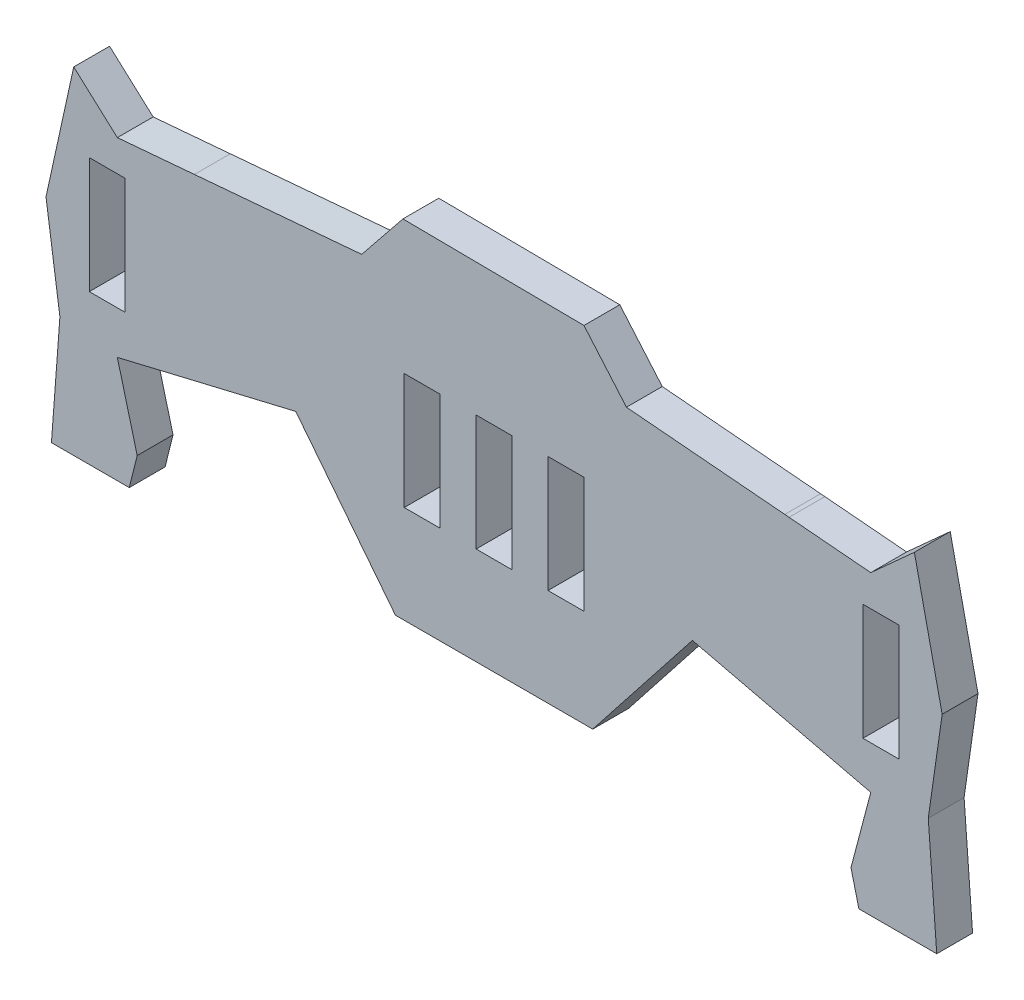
ISO-10303-21;
HEADER;
FILE_DESCRIPTION(('STEP AP214'),'2;1');
FILE_NAME('part.step','',(''),(''),'','','');
FILE_SCHEMA(('AUTOMOTIVE_DESIGN { 1 0 10303 214 1 1 1 1 }'));
ENDSEC;
DATA;
#1=APPLICATION_CONTEXT('core data for automotive mechanical design processes');
#2=APPLICATION_PROTOCOL_DEFINITION('international standard','automotive_design',2000,#1);
#3=PRODUCT_CONTEXT('',#1,'mechanical');
#4=PRODUCT('Part','Part','',(#3));
#5=PRODUCT_RELATED_PRODUCT_CATEGORY('part','',(#4));
#6=PRODUCT_DEFINITION_FORMATION('','',#4);
#7=PRODUCT_DEFINITION_CONTEXT('part definition',#1,'design');
#8=PRODUCT_DEFINITION('design','',#6,#7);
#9=PRODUCT_DEFINITION_SHAPE('','',#8);
#10=(LENGTH_UNIT() NAMED_UNIT(*) SI_UNIT(.MILLI.,.METRE.));
#11=(NAMED_UNIT(*) PLANE_ANGLE_UNIT() SI_UNIT($,.RADIAN.));
#12=(NAMED_UNIT(*) SI_UNIT($,.STERADIAN.) SOLID_ANGLE_UNIT());
#13=UNCERTAINTY_MEASURE_WITH_UNIT(LENGTH_MEASURE(1.E-05),#10,'distance_accuracy_value','');
#14=(GEOMETRIC_REPRESENTATION_CONTEXT(3) GLOBAL_UNCERTAINTY_ASSIGNED_CONTEXT((#13)) GLOBAL_UNIT_ASSIGNED_CONTEXT((#10,
#11,#12)) REPRESENTATION_CONTEXT('',''));
#15=CARTESIAN_POINT('',(0.,0.,0.));
#16=DIRECTION('',(0.,0.,1.));
#17=DIRECTION('',(1.,0.,0.));
#18=AXIS2_PLACEMENT_3D('',#15,#16,#17);
#19=CARTESIAN_POINT('',(0.,0.,3.));
#20=DIRECTION('',(0.,0.,1.));
#21=DIRECTION('',(1.,0.,0.));
#22=AXIS2_PLACEMENT_3D('',#19,#20,#21);
#23=PLANE('',#22);
#24=DIRECTION('',(0.972935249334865,-0.231077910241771,0.));
#25=VECTOR('',#24,1.);
#26=CARTESIAN_POINT('',(308.845488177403,538.802959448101,3.));
#27=LINE('',#26,#25);
#28=CARTESIAN_POINT('',(308.483580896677,538.888914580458,3.));
#29=VERTEX_POINT('',#28);
#30=CARTESIAN_POINT('',(308.845488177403,538.802959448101,3.));
#31=VERTEX_POINT('',#30);
#32=EDGE_CURVE('E591',#29,#31,#27,.T.);
#33=ORIENTED_EDGE('',*,*,#32,.T.);
#34=DIRECTION('',(0.972914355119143,-0.231165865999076,0.));
#35=VECTOR('',#34,1.);
#36=CARTESIAN_POINT('',(315.382212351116,537.249824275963,3.));
#37=LINE('',#36,#35);
#38=CARTESIAN_POINT('',(315.382212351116,537.249824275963,3.));
#39=VERTEX_POINT('',#38);
#40=EDGE_CURVE('E596',#31,#39,#37,.T.);
#41=ORIENTED_EDGE('',*,*,#40,.T.);
#42=DIRECTION('',(-0.255030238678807,-0.966933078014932,0.));
#43=VECTOR('',#42,1.);
#44=CARTESIAN_POINT('',(313.724130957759,530.963300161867,3.));
#45=LINE('',#44,#43);
#46=CARTESIAN_POINT('',(313.724130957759,530.963300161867,3.));
#47=VERTEX_POINT('',#46);
#48=EDGE_CURVE('E601',#39,#47,#45,.T.);
#49=ORIENTED_EDGE('',*,*,#48,.T.);
#50=DIRECTION('',(0.242232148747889,-0.970218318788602,0.));
#51=VECTOR('',#50,1.);
#52=CARTESIAN_POINT('',(314.387354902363,528.306873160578,3.));
#53=LINE('',#52,#51);
#54=CARTESIAN_POINT('',(314.387354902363,528.306873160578,3.));
#55=VERTEX_POINT('',#54);
#56=EDGE_CURVE('E603',#47,#55,#53,.T.);
#57=ORIENTED_EDGE('',*,*,#56,.T.);
#58=DIRECTION('',(1.,0.,0.));
#59=VECTOR('',#58,1.);
#60=CARTESIAN_POINT('',(320.903150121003,528.306873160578,3.));
#61=LINE('',#60,#59);
#62=CARTESIAN_POINT('',(320.903150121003,528.306873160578,3.));
#63=VERTEX_POINT('',#62);
#64=EDGE_CURVE('E610',#55,#63,#61,.T.);
#65=ORIENTED_EDGE('',*,*,#64,.T.);
#66=DIRECTION('',(-0.0746515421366,0.997209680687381,0.));
#67=VECTOR('',#66,1.);
#68=CARTESIAN_POINT('',(320.194063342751,537.778990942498,3.));
#69=LINE('',#68,#67);
#70=CARTESIAN_POINT('',(320.194063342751,537.778990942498,3.));
#71=VERTEX_POINT('',#70);
#72=EDGE_CURVE('E608',#63,#71,#69,.T.);
#73=ORIENTED_EDGE('',*,*,#72,.T.);
#74=DIRECTION('',(0.141904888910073,0.989880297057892,0.));
#75=VECTOR('',#74,1.);
#76=CARTESIAN_POINT('',(321.358247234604,545.899942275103,3.));
#77=LINE('',#76,#75);
#78=CARTESIAN_POINT('',(321.358247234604,545.899942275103,3.));
#79=VERTEX_POINT('',#78);
#80=EDGE_CURVE('E611',#71,#79,#77,.T.);
#81=ORIENTED_EDGE('',*,*,#80,.T.);
#82=DIRECTION('',(-0.214553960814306,0.976712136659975,0.));
#83=VECTOR('',#82,1.);
#84=CARTESIAN_POINT('',(319.033410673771,556.48327560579,3.));
#85=LINE('',#84,#83);
#86=CARTESIAN_POINT('',(319.033410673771,556.48327560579,3.));
#87=VERTEX_POINT('',#86);
#88=EDGE_CURVE('E618',#79,#87,#85,.T.);
#89=ORIENTED_EDGE('',*,*,#88,.T.);
#90=DIRECTION('',(-0.74168000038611,-0.670753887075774,0.));
#91=VECTOR('',#90,1.);
#92=CARTESIAN_POINT('',(315.382212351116,553.181237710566,3.));
#93=LINE('',#92,#91);
#94=CARTESIAN_POINT('',(315.382212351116,553.181237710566,3.));
#95=VERTEX_POINT('',#94);
#96=EDGE_CURVE('E620',#87,#95,#93,.T.);
#97=ORIENTED_EDGE('',*,*,#96,.T.);
#98=DIRECTION('',(-0.996302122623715,0.0859190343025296,0.));
#99=VECTOR('',#98,1.);
#100=CARTESIAN_POINT('',(308.539994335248,553.771296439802,3.));
#101=LINE('',#100,#99);
#102=CARTESIAN_POINT('',(308.539994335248,553.771296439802,3.));
#103=VERTEX_POINT('',#102);
#104=EDGE_CURVE('E625',#95,#103,#101,.T.);
#105=ORIENTED_EDGE('',*,*,#104,.T.);
#106=DIRECTION('',(-0.996295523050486,0.0859955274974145,0.));
#107=VECTOR('',#106,1.);
#108=CARTESIAN_POINT('',(308.183771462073,553.802043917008,3.));
#109=LINE('',#108,#107);
#110=CARTESIAN_POINT('',(308.183771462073,553.802043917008,3.));
#111=VERTEX_POINT('',#110);
#112=EDGE_CURVE('E622',#103,#111,#109,.T.);
#113=ORIENTED_EDGE('',*,*,#112,.T.);
#114=DIRECTION('',(-0.996302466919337,0.0859150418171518,0.));
#115=VECTOR('',#114,1.);
#116=CARTESIAN_POINT('',(294.928163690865,554.945126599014,3.));
#117=LINE('',#116,#115);
#118=CARTESIAN_POINT('',(294.928163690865,554.945126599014,3.));
#119=VERTEX_POINT('',#118);
#120=EDGE_CURVE('E628',#111,#119,#117,.T.);
#121=ORIENTED_EDGE('',*,*,#120,.T.);
#122=DIRECTION('',(-0.650609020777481,0.759412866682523,0.));
#123=VECTOR('',#122,1.);
#124=CARTESIAN_POINT('',(291.372265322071,559.095691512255,3.));
#125=LINE('',#124,#123);
#126=CARTESIAN_POINT('',(291.372265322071,559.095691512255,3.));
#127=VERTEX_POINT('',#126);
#128=EDGE_CURVE('E631',#119,#127,#125,.T.);
#129=ORIENTED_EDGE('',*,*,#128,.T.);
#130=DIRECTION('',(-0.99995295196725,0.00970019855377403,0.));
#131=VECTOR('',#130,1.);
#132=CARTESIAN_POINT('',(276.216644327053,559.242710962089,3.));
#133=LINE('',#132,#131);
#134=CARTESIAN_POINT('',(276.216644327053,559.242710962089,3.));
#135=VERTEX_POINT('',#134);
#136=EDGE_CURVE('E632',#127,#135,#133,.T.);
#137=ORIENTED_EDGE('',*,*,#136,.T.);
#138=DIRECTION('',(-0.62601491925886,-0.779811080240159,0.));
#139=VECTOR('',#138,1.);
#140=CARTESIAN_POINT('',(272.766639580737,554.945126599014,3.));
#141=LINE('',#140,#139);
#142=CARTESIAN_POINT('',(272.766639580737,554.945126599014,3.));
#143=VERTEX_POINT('',#142);
#144=EDGE_CURVE('E640',#135,#143,#141,.T.);
#145=ORIENTED_EDGE('',*,*,#144,.T.);
#146=DIRECTION('',(-0.99630398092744,-0.0858974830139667,0.));
#147=VECTOR('',#146,1.);
#148=CARTESIAN_POINT('',(259.110711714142,553.767765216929,3.));
#149=LINE('',#148,#147);
#150=CARTESIAN_POINT('',(259.110711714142,553.767765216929,3.));
#151=VERTEX_POINT('',#150);
#152=EDGE_CURVE('E639',#143,#151,#149,.T.);
#153=ORIENTED_EDGE('',*,*,#152,.T.);
#154=DIRECTION('',(-0.996304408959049,-0.0858925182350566,0.));
#155=VECTOR('',#154,1.);
#156=CARTESIAN_POINT('',(258.759053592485,553.737448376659,3.));
#157=LINE('',#156,#155);
#158=CARTESIAN_POINT('',(258.759053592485,553.737448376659,3.));
#159=VERTEX_POINT('',#158);
#160=EDGE_CURVE('E644',#151,#159,#157,.T.);
#161=ORIENTED_EDGE('',*,*,#160,.T.);
#162=DIRECTION('',(-0.996302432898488,-0.0859154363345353,0.));
#163=VECTOR('',#162,1.);
#164=CARTESIAN_POINT('',(252.309059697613,553.181237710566,3.));
#165=LINE('',#164,#163);
#166=CARTESIAN_POINT('',(252.309059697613,553.181237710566,3.));
#167=VERTEX_POINT('',#166);
#168=EDGE_CURVE('E646',#159,#167,#165,.T.);
#169=ORIENTED_EDGE('',*,*,#168,.T.);
#170=DIRECTION('',(-0.741687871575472,0.670745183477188,0.));
#171=VECTOR('',#170,1.);
#172=CARTESIAN_POINT('',(248.657775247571,556.48327560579,3.));
#173=LINE('',#172,#171);
#174=CARTESIAN_POINT('',(248.657775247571,556.48327560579,3.));
#175=VERTEX_POINT('',#174);
#176=EDGE_CURVE('E648',#167,#175,#173,.T.);
#177=ORIENTED_EDGE('',*,*,#176,.T.);
#178=DIRECTION('',(-0.214239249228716,-0.976781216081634,0.));
#179=VECTOR('',#178,1.);
#180=CARTESIAN_POINT('',(246.336512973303,545.899942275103,3.));
#181=LINE('',#180,#179);
#182=CARTESIAN_POINT('',(246.336512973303,545.899942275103,3.));
#183=VERTEX_POINT('',#182);
#184=EDGE_CURVE('E655',#175,#183,#181,.T.);
#185=ORIENTED_EDGE('',*,*,#184,.T.);
#186=DIRECTION('',(0.141899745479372,-0.989881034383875,0.));
#187=VECTOR('',#186,1.);
#188=CARTESIAN_POINT('',(247.500653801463,537.778990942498,3.));
#189=LINE('',#188,#187);
#190=CARTESIAN_POINT('',(247.500653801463,537.778990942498,3.));
#191=VERTEX_POINT('',#190);
#192=EDGE_CURVE('E653',#183,#191,#189,.T.);
#193=ORIENTED_EDGE('',*,*,#192,.T.);
#194=DIRECTION('',(-0.0746515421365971,-0.997209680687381,0.));
#195=VECTOR('',#194,1.);
#196=CARTESIAN_POINT('',(246.791567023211,528.306873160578,3.));
#197=LINE('',#196,#195);
#198=CARTESIAN_POINT('',(246.791567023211,528.306873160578,3.));
#199=VERTEX_POINT('',#198);
#200=EDGE_CURVE('E656',#191,#199,#197,.T.);
#201=ORIENTED_EDGE('',*,*,#200,.T.);
#202=DIRECTION('',(1.,0.,0.));
#203=VECTOR('',#202,1.);
#204=CARTESIAN_POINT('',(253.307405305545,528.306873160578,3.));
#205=LINE('',#204,#203);
#206=CARTESIAN_POINT('',(253.307405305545,528.306873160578,3.));
#207=VERTEX_POINT('',#206);
#208=EDGE_CURVE('E662',#199,#207,#205,.T.);
#209=ORIENTED_EDGE('',*,*,#208,.T.);
#210=DIRECTION('',(0.242232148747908,0.970218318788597,0.));
#211=VECTOR('',#210,1.);
#212=CARTESIAN_POINT('',(253.970629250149,530.963300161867,3.));
#213=LINE('',#212,#211);
#214=CARTESIAN_POINT('',(253.970629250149,530.963300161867,3.));
#215=VERTEX_POINT('',#214);
#216=EDGE_CURVE('E664',#207,#215,#213,.T.);
#217=ORIENTED_EDGE('',*,*,#216,.T.);
#218=DIRECTION('',(-0.255531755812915,0.966800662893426,0.));
#219=VECTOR('',#218,1.);
#220=CARTESIAN_POINT('',(252.309059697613,537.249824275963,3.));
#221=LINE('',#220,#219);
#222=CARTESIAN_POINT('',(252.309059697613,537.249824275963,3.));
#223=VERTEX_POINT('',#222);
#224=EDGE_CURVE('E670',#215,#223,#221,.T.);
#225=ORIENTED_EDGE('',*,*,#224,.T.);
#226=DIRECTION('',(0.972913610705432,0.231168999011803,0.));
#227=VECTOR('',#226,1.);
#228=CARTESIAN_POINT('',(258.849315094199,538.803820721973,3.));
#229=LINE('',#228,#227);
#230=CARTESIAN_POINT('',(258.849315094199,538.803820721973,3.));
#231=VERTEX_POINT('',#230);
#232=EDGE_CURVE('E669',#223,#231,#229,.T.);
#233=ORIENTED_EDGE('',*,*,#232,.T.);
#234=DIRECTION('',(0.972927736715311,0.231109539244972,0.));
#235=VECTOR('',#234,1.);
#236=CARTESIAN_POINT('',(259.196666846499,538.886330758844,3.));
#237=LINE('',#236,#235);
#238=CARTESIAN_POINT('',(259.196666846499,538.886330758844,3.));
#239=VERTEX_POINT('',#238);
#240=EDGE_CURVE('E674',#231,#239,#237,.T.);
#241=ORIENTED_EDGE('',*,*,#240,.T.);
#242=DIRECTION('',(0.972914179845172,0.231166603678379,0.));
#243=VECTOR('',#242,1.);
#244=CARTESIAN_POINT('',(267.245658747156,540.798789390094,3.));
#245=LINE('',#244,#243);
#246=CARTESIAN_POINT('',(267.245658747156,540.798789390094,3.));
#247=VERTEX_POINT('',#246);
#248=EDGE_CURVE('E678',#239,#247,#245,.T.);
#249=ORIENTED_EDGE('',*,*,#248,.T.);
#250=DIRECTION('',(0.618388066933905,-0.78587288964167,0.));
#251=VECTOR('',#250,1.);
#252=CARTESIAN_POINT('',(275.588861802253,530.195905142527,3.));
#253=LINE('',#252,#251);
#254=CARTESIAN_POINT('',(275.588861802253,530.195905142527,3.));
#255=VERTEX_POINT('',#254);
#256=EDGE_CURVE('E677',#247,#255,#253,.T.);
#257=ORIENTED_EDGE('',*,*,#256,.T.);
#258=DIRECTION('',(1.,0.,0.));
#259=VECTOR('',#258,1.);
#260=CARTESIAN_POINT('',(292.105898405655,530.195905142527,3.));
#261=LINE('',#260,#259);
#262=CARTESIAN_POINT('',(292.105898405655,530.195905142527,3.));
#263=VERTEX_POINT('',#262);
#264=EDGE_CURVE('E682',#255,#263,#261,.T.);
#265=ORIENTED_EDGE('',*,*,#264,.T.);
#266=DIRECTION('',(0.618226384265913,0.786000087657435,0.));
#267=VECTOR('',#266,1.);
#268=CARTESIAN_POINT('',(300.445570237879,540.798789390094,3.));
#269=LINE('',#268,#267);
#270=CARTESIAN_POINT('',(300.445570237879,540.798789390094,3.));
#271=VERTEX_POINT('',#270);
#272=EDGE_CURVE('E684',#263,#271,#269,.T.);
#273=ORIENTED_EDGE('',*,*,#272,.T.);
#274=DIRECTION('',(0.972913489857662,-0.231169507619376,0.));
#275=VECTOR('',#274,1.);
#276=CARTESIAN_POINT('',(308.483580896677,538.888914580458,3.));
#277=LINE('',#276,#275);
#278=EDGE_CURVE('E686',#271,#29,#277,.T.);
#279=ORIENTED_EDGE('',*,*,#278,.T.);
#280=EDGE_LOOP('',(#33,#41,#49,#57,#65,#73,#81,#89,#97,#105,#113,#121,#129,#137,#145,#153,#161,
#169,#177,#185,#193,#201,#209,#217,#225,#233,#241,#249,#257,#265,#273,#279));
#281=FACE_BOUND('',#280,.T.);
#282=DIRECTION('',(-1.,0.,0.));
#283=VECTOR('',#282,1.);
#284=CARTESIAN_POINT('',(314.725792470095,550.559089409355,3.));
#285=LINE('',#284,#283);
#286=CARTESIAN_POINT('',(317.73435129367,550.559089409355,3.));
#287=VERTEX_POINT('',#286);
#288=CARTESIAN_POINT('',(314.725792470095,550.559089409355,3.));
#289=VERTEX_POINT('',#288);
#290=EDGE_CURVE('E555',#287,#289,#285,.T.);
#291=ORIENTED_EDGE('',*,*,#290,.F.);
#292=DIRECTION('',(0.,1.,0.));
#293=VECTOR('',#292,1.);
#294=CARTESIAN_POINT('',(317.73435129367,550.559089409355,3.));
#295=LINE('',#294,#293);
#296=CARTESIAN_POINT('',(317.73435129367,540.842455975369,3.));
#297=VERTEX_POINT('',#296);
#298=EDGE_CURVE('E549',#297,#287,#295,.T.);
#299=ORIENTED_EDGE('',*,*,#298,.F.);
#300=DIRECTION('',(1.,0.,0.));
#301=VECTOR('',#300,1.);
#302=CARTESIAN_POINT('',(317.73435129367,540.842455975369,3.));
#303=LINE('',#302,#301);
#304=CARTESIAN_POINT('',(314.725792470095,540.842455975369,3.));
#305=VERTEX_POINT('',#304);
#306=EDGE_CURVE('E561',#305,#297,#303,.T.);
#307=ORIENTED_EDGE('',*,*,#306,.F.);
#308=DIRECTION('',(0.,-1.,0.));
#309=VECTOR('',#308,1.);
#310=CARTESIAN_POINT('',(314.725792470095,540.842455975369,3.));
#311=LINE('',#310,#309);
#312=EDGE_CURVE('E560',#289,#305,#311,.T.);
#313=ORIENTED_EDGE('',*,*,#312,.F.);
#314=EDGE_LOOP('',(#291,#299,#307,#313));
#315=FACE_BOUND('',#314,.T.);
#316=DIRECTION('',(-1.,0.,0.));
#317=VECTOR('',#316,1.);
#318=CARTESIAN_POINT('',(288.360089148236,548.089644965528,3.));
#319=LINE('',#318,#317);
#320=CARTESIAN_POINT('',(291.368691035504,548.089644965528,3.));
#321=VERTEX_POINT('',#320);
#322=CARTESIAN_POINT('',(288.360089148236,548.089644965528,3.));
#323=VERTEX_POINT('',#322);
#324=EDGE_CURVE('E512',#321,#323,#319,.T.);
#325=ORIENTED_EDGE('',*,*,#324,.F.);
#326=DIRECTION('',(0.,1.,0.));
#327=VECTOR('',#326,1.);
#328=CARTESIAN_POINT('',(291.368691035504,548.089644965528,3.));
#329=LINE('',#328,#327);
#330=CARTESIAN_POINT('',(291.368691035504,538.373011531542,3.));
#331=VERTEX_POINT('',#330);
#332=EDGE_CURVE('E510',#331,#321,#329,.T.);
#333=ORIENTED_EDGE('',*,*,#332,.F.);
#334=DIRECTION('',(1.,0.,0.));
#335=VECTOR('',#334,1.);
#336=CARTESIAN_POINT('',(291.368691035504,538.373011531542,3.));
#337=LINE('',#336,#335);
#338=CARTESIAN_POINT('',(288.360089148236,538.373011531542,3.));
#339=VERTEX_POINT('',#338);
#340=EDGE_CURVE('E517',#339,#331,#337,.T.);
#341=ORIENTED_EDGE('',*,*,#340,.F.);
#342=DIRECTION('',(0.,-1.,0.));
#343=VECTOR('',#342,1.);
#344=CARTESIAN_POINT('',(288.360089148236,538.373011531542,3.));
#345=LINE('',#344,#343);
#346=EDGE_CURVE('E511',#323,#339,#345,.T.);
#347=ORIENTED_EDGE('',*,*,#346,.F.);
#348=EDGE_LOOP('',(#325,#333,#341,#347));
#349=FACE_BOUND('',#348,.T.);
#350=DIRECTION('',(-1.,0.,0.));
#351=VECTOR('',#350,1.);
#352=CARTESIAN_POINT('',(282.342971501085,548.089644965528,3.));
#353=LINE('',#352,#351);
#354=CARTESIAN_POINT('',(285.351573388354,548.089644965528,3.));
#355=VERTEX_POINT('',#354);
#356=CARTESIAN_POINT('',(282.342971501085,548.089644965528,3.));
#357=VERTEX_POINT('',#356);
#358=EDGE_CURVE('E466',#355,#357,#353,.T.);
#359=ORIENTED_EDGE('',*,*,#358,.F.);
#360=DIRECTION('',(0.,1.,0.));
#361=VECTOR('',#360,1.);
#362=CARTESIAN_POINT('',(285.351573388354,548.089644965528,3.));
#363=LINE('',#362,#361);
#364=CARTESIAN_POINT('',(285.351573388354,538.373011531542,3.));
#365=VERTEX_POINT('',#364);
#366=EDGE_CURVE('E462',#365,#355,#363,.T.);
#367=ORIENTED_EDGE('',*,*,#366,.F.);
#368=DIRECTION('',(1.,0.,0.));
#369=VECTOR('',#368,1.);
#370=CARTESIAN_POINT('',(285.351573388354,538.373011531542,3.));
#371=LINE('',#370,#369);
#372=CARTESIAN_POINT('',(282.342971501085,538.373011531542,3.));
#373=VERTEX_POINT('',#372);
#374=EDGE_CURVE('E474',#373,#365,#371,.T.);
#375=ORIENTED_EDGE('',*,*,#374,.F.);
#376=DIRECTION('',(0.,-1.,0.));
#377=VECTOR('',#376,1.);
#378=CARTESIAN_POINT('',(282.342971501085,538.373011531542,3.));
#379=LINE('',#378,#377);
#380=EDGE_CURVE('E471',#357,#373,#379,.T.);
#381=ORIENTED_EDGE('',*,*,#380,.F.);
#382=EDGE_LOOP('',(#359,#367,#375,#381));
#383=FACE_BOUND('',#382,.T.);
#384=DIRECTION('',(-1.,0.,0.));
#385=VECTOR('',#384,1.);
#386=CARTESIAN_POINT('',(276.325853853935,548.089644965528,3.));
#387=LINE('',#386,#385);
#388=CARTESIAN_POINT('',(279.334455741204,548.089644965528,3.));
#389=VERTEX_POINT('',#388);
#390=CARTESIAN_POINT('',(276.325853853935,548.089644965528,3.));
#391=VERTEX_POINT('',#390);
#392=EDGE_CURVE('E429',#389,#391,#387,.T.);
#393=ORIENTED_EDGE('',*,*,#392,.F.);
#394=DIRECTION('',(0.,1.,0.));
#395=VECTOR('',#394,1.);
#396=CARTESIAN_POINT('',(279.334455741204,548.089644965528,3.));
#397=LINE('',#396,#395);
#398=CARTESIAN_POINT('',(279.334455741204,538.373011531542,3.));
#399=VERTEX_POINT('',#398);
#400=EDGE_CURVE('E424',#399,#389,#397,.T.);
#401=ORIENTED_EDGE('',*,*,#400,.F.);
#402=DIRECTION('',(1.,0.,0.));
#403=VECTOR('',#402,1.);
#404=CARTESIAN_POINT('',(279.334455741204,538.373011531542,3.));
#405=LINE('',#404,#403);
#406=CARTESIAN_POINT('',(276.325853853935,538.373011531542,3.));
#407=VERTEX_POINT('',#406);
#408=EDGE_CURVE('E436',#407,#399,#405,.T.);
#409=ORIENTED_EDGE('',*,*,#408,.F.);
#410=DIRECTION('',(0.,-1.,0.));
#411=VECTOR('',#410,1.);
#412=CARTESIAN_POINT('',(276.325853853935,538.373011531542,3.));
#413=LINE('',#412,#411);
#414=EDGE_CURVE('E435',#391,#407,#413,.T.);
#415=ORIENTED_EDGE('',*,*,#414,.F.);
#416=EDGE_LOOP('',(#393,#401,#409,#415));
#417=FACE_BOUND('',#416,.T.);
#418=DIRECTION('',(1.,0.,0.));
#419=VECTOR('',#418,1.);
#420=CARTESIAN_POINT('',(252.968709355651,540.842455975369,3.));
#421=LINE('',#420,#419);
#422=CARTESIAN_POINT('',(249.96019359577,540.842455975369,3.));
#423=VERTEX_POINT('',#422);
#424=CARTESIAN_POINT('',(252.968709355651,540.842455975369,3.));
#425=VERTEX_POINT('',#424);
#426=EDGE_CURVE('E77',#423,#425,#421,.T.);
#427=ORIENTED_EDGE('',*,*,#426,.F.);
#428=DIRECTION('',(0.,-1.,0.));
#429=VECTOR('',#428,1.);
#430=CARTESIAN_POINT('',(249.96019359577,540.842455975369,3.));
#431=LINE('',#430,#429);
#432=CARTESIAN_POINT('',(249.96019359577,550.559089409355,3.));
#433=VERTEX_POINT('',#432);
#434=EDGE_CURVE('E47',#433,#423,#431,.T.);
#435=ORIENTED_EDGE('',*,*,#434,.F.);
#436=DIRECTION('',(-1.,0.,0.));
#437=VECTOR('',#436,1.);
#438=CARTESIAN_POINT('',(249.96019359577,550.559089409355,3.));
#439=LINE('',#438,#437);
#440=CARTESIAN_POINT('',(252.968709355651,550.559089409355,3.));
#441=VERTEX_POINT('',#440);
#442=EDGE_CURVE('E381',#441,#433,#439,.T.);
#443=ORIENTED_EDGE('',*,*,#442,.F.);
#444=DIRECTION('',(0.,1.,0.));
#445=VECTOR('',#444,1.);
#446=CARTESIAN_POINT('',(252.968709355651,550.559089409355,3.));
#447=LINE('',#446,#445);
#448=EDGE_CURVE('E394',#425,#441,#447,.T.);
#449=ORIENTED_EDGE('',*,*,#448,.F.);
#450=EDGE_LOOP('',(#427,#435,#443,#449));
#451=FACE_BOUND('',#450,.T.);
#452=ADVANCED_FACE('F44',(#281,#315,#349,#383,#417,#451),#23,.T.);
#453=CARTESIAN_POINT('',(0.,0.,0.));
#454=DIRECTION('',(0.,0.,1.));
#455=DIRECTION('',(1.,0.,0.));
#456=AXIS2_PLACEMENT_3D('',#453,#454,#455);
#457=PLANE('',#456);
#458=DIRECTION('',(0.,1.,0.));
#459=VECTOR('',#458,1.);
#460=CARTESIAN_POINT('',(279.334455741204,548.089644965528,0.));
#461=LINE('',#460,#459);
#462=CARTESIAN_POINT('',(279.334455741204,538.373011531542,0.));
#463=VERTEX_POINT('',#462);
#464=CARTESIAN_POINT('',(279.334455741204,548.089644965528,0.));
#465=VERTEX_POINT('',#464);
#466=EDGE_CURVE('E418',#463,#465,#461,.T.);
#467=ORIENTED_EDGE('',*,*,#466,.T.);
#468=DIRECTION('',(-1.,0.,0.));
#469=VECTOR('',#468,1.);
#470=CARTESIAN_POINT('',(276.325853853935,548.089644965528,0.));
#471=LINE('',#470,#469);
#472=CARTESIAN_POINT('',(276.325853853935,548.089644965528,0.));
#473=VERTEX_POINT('',#472);
#474=EDGE_CURVE('E422',#465,#473,#471,.T.);
#475=ORIENTED_EDGE('',*,*,#474,.T.);
#476=DIRECTION('',(0.,-1.,0.));
#477=VECTOR('',#476,1.);
#478=CARTESIAN_POINT('',(276.325853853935,538.373011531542,0.));
#479=LINE('',#478,#477);
#480=CARTESIAN_POINT('',(276.325853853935,538.373011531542,0.));
#481=VERTEX_POINT('',#480);
#482=EDGE_CURVE('E442',#473,#481,#479,.T.);
#483=ORIENTED_EDGE('',*,*,#482,.T.);
#484=DIRECTION('',(1.,0.,0.));
#485=VECTOR('',#484,1.);
#486=CARTESIAN_POINT('',(279.334455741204,538.373011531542,0.));
#487=LINE('',#486,#485);
#488=EDGE_CURVE('E426',#481,#463,#487,.T.);
#489=ORIENTED_EDGE('',*,*,#488,.T.);
#490=EDGE_LOOP('',(#467,#475,#483,#489));
#491=FACE_BOUND('',#490,.T.);
#492=DIRECTION('',(0.,1.,0.));
#493=VECTOR('',#492,1.);
#494=CARTESIAN_POINT('',(291.368691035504,548.089644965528,0.));
#495=LINE('',#494,#493);
#496=CARTESIAN_POINT('',(291.368691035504,538.373011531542,0.));
#497=VERTEX_POINT('',#496);
#498=CARTESIAN_POINT('',(291.368691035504,548.089644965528,0.));
#499=VERTEX_POINT('',#498);
#500=EDGE_CURVE('E506',#497,#499,#495,.T.);
#501=ORIENTED_EDGE('',*,*,#500,.T.);
#502=DIRECTION('',(-1.,0.,0.));
#503=VECTOR('',#502,1.);
#504=CARTESIAN_POINT('',(288.360089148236,548.089644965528,0.));
#505=LINE('',#504,#503);
#506=CARTESIAN_POINT('',(288.360089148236,548.089644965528,0.));
#507=VERTEX_POINT('',#506);
#508=EDGE_CURVE('E523',#499,#507,#505,.T.);
#509=ORIENTED_EDGE('',*,*,#508,.T.);
#510=DIRECTION('',(0.,-1.,0.));
#511=VECTOR('',#510,1.);
#512=CARTESIAN_POINT('',(288.360089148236,538.373011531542,0.));
#513=LINE('',#512,#511);
#514=CARTESIAN_POINT('',(288.360089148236,538.373011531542,0.));
#515=VERTEX_POINT('',#514);
#516=EDGE_CURVE('E527',#507,#515,#513,.T.);
#517=ORIENTED_EDGE('',*,*,#516,.T.);
#518=DIRECTION('',(1.,0.,0.));
#519=VECTOR('',#518,1.);
#520=CARTESIAN_POINT('',(291.368691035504,538.373011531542,0.));
#521=LINE('',#520,#519);
#522=EDGE_CURVE('E509',#515,#497,#521,.T.);
#523=ORIENTED_EDGE('',*,*,#522,.T.);
#524=EDGE_LOOP('',(#501,#509,#517,#523));
#525=FACE_BOUND('',#524,.T.);
#526=DIRECTION('',(0.972935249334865,-0.231077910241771,0.));
#527=VECTOR('',#526,1.);
#528=CARTESIAN_POINT('',(308.845488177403,538.802959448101,0.));
#529=LINE('',#528,#527);
#530=CARTESIAN_POINT('',(308.483580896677,538.888914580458,0.));
#531=VERTEX_POINT('',#530);
#532=CARTESIAN_POINT('',(308.845488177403,538.802959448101,0.));
#533=VERTEX_POINT('',#532);
#534=EDGE_CURVE('E595',#531,#533,#529,.T.);
#535=ORIENTED_EDGE('',*,*,#534,.F.);
#536=DIRECTION('',(0.972913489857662,-0.231169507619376,0.));
#537=VECTOR('',#536,1.);
#538=CARTESIAN_POINT('',(308.483580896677,538.888914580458,0.));
#539=LINE('',#538,#537);
#540=CARTESIAN_POINT('',(300.445570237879,540.798789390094,0.));
#541=VERTEX_POINT('',#540);
#542=EDGE_CURVE('E600',#541,#531,#539,.T.);
#543=ORIENTED_EDGE('',*,*,#542,.F.);
#544=DIRECTION('',(0.618226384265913,0.786000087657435,0.));
#545=VECTOR('',#544,1.);
#546=CARTESIAN_POINT('',(300.445570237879,540.798789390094,0.));
#547=LINE('',#546,#545);
#548=CARTESIAN_POINT('',(292.105898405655,530.195905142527,0.));
#549=VERTEX_POINT('',#548);
#550=EDGE_CURVE('E785',#549,#541,#547,.T.);
#551=ORIENTED_EDGE('',*,*,#550,.F.);
#552=DIRECTION('',(1.,0.,0.));
#553=VECTOR('',#552,1.);
#554=CARTESIAN_POINT('',(292.105898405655,530.195905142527,0.));
#555=LINE('',#554,#553);
#556=CARTESIAN_POINT('',(275.588861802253,530.195905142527,0.));
#557=VERTEX_POINT('',#556);
#558=EDGE_CURVE('E778',#557,#549,#555,.T.);
#559=ORIENTED_EDGE('',*,*,#558,.F.);
#560=DIRECTION('',(0.618388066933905,-0.78587288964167,0.));
#561=VECTOR('',#560,1.);
#562=CARTESIAN_POINT('',(275.588861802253,530.195905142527,0.));
#563=LINE('',#562,#561);
#564=CARTESIAN_POINT('',(267.245658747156,540.798789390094,0.));
#565=VERTEX_POINT('',#564);
#566=EDGE_CURVE('E776',#565,#557,#563,.T.);
#567=ORIENTED_EDGE('',*,*,#566,.F.);
#568=DIRECTION('',(0.972914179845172,0.231166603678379,0.));
#569=VECTOR('',#568,1.);
#570=CARTESIAN_POINT('',(267.245658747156,540.798789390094,0.));
#571=LINE('',#570,#569);
#572=CARTESIAN_POINT('',(259.196666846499,538.886330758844,0.));
#573=VERTEX_POINT('',#572);
#574=EDGE_CURVE('E774',#573,#565,#571,.T.);
#575=ORIENTED_EDGE('',*,*,#574,.F.);
#576=DIRECTION('',(0.972927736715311,0.231109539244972,0.));
#577=VECTOR('',#576,1.);
#578=CARTESIAN_POINT('',(259.196666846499,538.886330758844,0.));
#579=LINE('',#578,#577);
#580=CARTESIAN_POINT('',(258.849315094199,538.803820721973,0.));
#581=VERTEX_POINT('',#580);
#582=EDGE_CURVE('E769',#581,#573,#579,.T.);
#583=ORIENTED_EDGE('',*,*,#582,.F.);
#584=DIRECTION('',(0.972913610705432,0.231168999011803,0.));
#585=VECTOR('',#584,1.);
#586=CARTESIAN_POINT('',(258.849315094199,538.803820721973,0.));
#587=LINE('',#586,#585);
#588=CARTESIAN_POINT('',(252.309059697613,537.249824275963,0.));
#589=VERTEX_POINT('',#588);
#590=EDGE_CURVE('E770',#589,#581,#587,.T.);
#591=ORIENTED_EDGE('',*,*,#590,.F.);
#592=DIRECTION('',(-0.255531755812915,0.966800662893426,0.));
#593=VECTOR('',#592,1.);
#594=CARTESIAN_POINT('',(252.309059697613,537.249824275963,0.));
#595=LINE('',#594,#593);
#596=CARTESIAN_POINT('',(253.970629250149,530.963300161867,0.));
#597=VERTEX_POINT('',#596);
#598=EDGE_CURVE('E762',#597,#589,#595,.T.);
#599=ORIENTED_EDGE('',*,*,#598,.F.);
#600=DIRECTION('',(0.242232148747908,0.970218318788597,0.));
#601=VECTOR('',#600,1.);
#602=CARTESIAN_POINT('',(253.970629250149,530.963300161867,0.));
#603=LINE('',#602,#601);
#604=CARTESIAN_POINT('',(253.307405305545,528.306873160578,0.));
#605=VERTEX_POINT('',#604);
#606=EDGE_CURVE('E761',#605,#597,#603,.T.);
#607=ORIENTED_EDGE('',*,*,#606,.F.);
#608=DIRECTION('',(1.,0.,0.));
#609=VECTOR('',#608,1.);
#610=CARTESIAN_POINT('',(253.307405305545,528.306873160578,0.));
#611=LINE('',#610,#609);
#612=CARTESIAN_POINT('',(246.791567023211,528.306873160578,0.));
#613=VERTEX_POINT('',#612);
#614=EDGE_CURVE('E758',#613,#605,#611,.T.);
#615=ORIENTED_EDGE('',*,*,#614,.F.);
#616=DIRECTION('',(-0.0746515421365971,-0.997209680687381,0.));
#617=VECTOR('',#616,1.);
#618=CARTESIAN_POINT('',(246.791567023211,528.306873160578,0.));
#619=LINE('',#618,#617);
#620=CARTESIAN_POINT('',(247.500653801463,537.778990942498,0.));
#621=VERTEX_POINT('',#620);
#622=EDGE_CURVE('E752',#621,#613,#619,.T.);
#623=ORIENTED_EDGE('',*,*,#622,.F.);
#624=DIRECTION('',(0.141899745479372,-0.989881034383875,0.));
#625=VECTOR('',#624,1.);
#626=CARTESIAN_POINT('',(247.500653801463,537.778990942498,0.));
#627=LINE('',#626,#625);
#628=CARTESIAN_POINT('',(246.336512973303,545.899942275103,0.));
#629=VERTEX_POINT('',#628);
#630=EDGE_CURVE('E755',#629,#621,#627,.T.);
#631=ORIENTED_EDGE('',*,*,#630,.F.);
#632=DIRECTION('',(-0.214239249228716,-0.976781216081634,0.));
#633=VECTOR('',#632,1.);
#634=CARTESIAN_POINT('',(246.336512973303,545.899942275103,0.));
#635=LINE('',#634,#633);
#636=CARTESIAN_POINT('',(248.657775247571,556.48327560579,0.));
#637=VERTEX_POINT('',#636);
#638=EDGE_CURVE('E750',#637,#629,#635,.T.);
#639=ORIENTED_EDGE('',*,*,#638,.F.);
#640=DIRECTION('',(-0.741687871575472,0.670745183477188,0.));
#641=VECTOR('',#640,1.);
#642=CARTESIAN_POINT('',(248.657775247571,556.48327560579,0.));
#643=LINE('',#642,#641);
#644=CARTESIAN_POINT('',(252.309059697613,553.181237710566,0.));
#645=VERTEX_POINT('',#644);
#646=EDGE_CURVE('E748',#645,#637,#643,.T.);
#647=ORIENTED_EDGE('',*,*,#646,.F.);
#648=DIRECTION('',(-0.996302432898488,-0.0859154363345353,0.));
#649=VECTOR('',#648,1.);
#650=CARTESIAN_POINT('',(252.309059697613,553.181237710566,0.));
#651=LINE('',#650,#649);
#652=CARTESIAN_POINT('',(258.759053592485,553.737448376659,0.));
#653=VERTEX_POINT('',#652);
#654=EDGE_CURVE('E741',#653,#645,#651,.T.);
#655=ORIENTED_EDGE('',*,*,#654,.F.);
#656=DIRECTION('',(-0.996304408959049,-0.0858925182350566,0.));
#657=VECTOR('',#656,1.);
#658=CARTESIAN_POINT('',(258.759053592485,553.737448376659,0.));
#659=LINE('',#658,#657);
#660=CARTESIAN_POINT('',(259.110711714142,553.767765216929,0.));
#661=VERTEX_POINT('',#660);
#662=EDGE_CURVE('E738',#661,#653,#659,.T.);
#663=ORIENTED_EDGE('',*,*,#662,.F.);
#664=DIRECTION('',(-0.99630398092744,-0.0858974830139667,0.));
#665=VECTOR('',#664,1.);
#666=CARTESIAN_POINT('',(259.110711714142,553.767765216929,0.));
#667=LINE('',#666,#665);
#668=CARTESIAN_POINT('',(272.766639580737,554.945126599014,0.));
#669=VERTEX_POINT('',#668);
#670=EDGE_CURVE('E740',#669,#661,#667,.T.);
#671=ORIENTED_EDGE('',*,*,#670,.F.);
#672=DIRECTION('',(-0.62601491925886,-0.779811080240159,0.));
#673=VECTOR('',#672,1.);
#674=CARTESIAN_POINT('',(272.766639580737,554.945126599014,0.));
#675=LINE('',#674,#673);
#676=CARTESIAN_POINT('',(276.216644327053,559.242710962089,0.));
#677=VERTEX_POINT('',#676);
#678=EDGE_CURVE('E733',#677,#669,#675,.T.);
#679=ORIENTED_EDGE('',*,*,#678,.F.);
#680=DIRECTION('',(-0.99995295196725,0.00970019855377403,0.));
#681=VECTOR('',#680,1.);
#682=CARTESIAN_POINT('',(276.216644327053,559.242710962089,0.));
#683=LINE('',#682,#681);
#684=CARTESIAN_POINT('',(291.372265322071,559.095691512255,0.));
#685=VERTEX_POINT('',#684);
#686=EDGE_CURVE('E731',#685,#677,#683,.T.);
#687=ORIENTED_EDGE('',*,*,#686,.F.);
#688=DIRECTION('',(-0.650609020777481,0.759412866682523,0.));
#689=VECTOR('',#688,1.);
#690=CARTESIAN_POINT('',(291.372265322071,559.095691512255,0.));
#691=LINE('',#690,#689);
#692=CARTESIAN_POINT('',(294.928163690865,554.945126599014,0.));
#693=VERTEX_POINT('',#692);
#694=EDGE_CURVE('E726',#693,#685,#691,.T.);
#695=ORIENTED_EDGE('',*,*,#694,.F.);
#696=DIRECTION('',(-0.996302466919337,0.0859150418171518,0.));
#697=VECTOR('',#696,1.);
#698=CARTESIAN_POINT('',(294.928163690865,554.945126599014,0.));
#699=LINE('',#698,#697);
#700=CARTESIAN_POINT('',(308.183771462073,553.802043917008,0.));
#701=VERTEX_POINT('',#700);
#702=EDGE_CURVE('E724',#701,#693,#699,.T.);
#703=ORIENTED_EDGE('',*,*,#702,.F.);
#704=DIRECTION('',(-0.996295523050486,0.0859955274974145,0.));
#705=VECTOR('',#704,1.);
#706=CARTESIAN_POINT('',(308.183771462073,553.802043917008,0.));
#707=LINE('',#706,#705);
#708=CARTESIAN_POINT('',(308.539994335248,553.771296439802,0.));
#709=VERTEX_POINT('',#708);
#710=EDGE_CURVE('E725',#709,#701,#707,.T.);
#711=ORIENTED_EDGE('',*,*,#710,.F.);
#712=DIRECTION('',(-0.996302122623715,0.0859190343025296,0.));
#713=VECTOR('',#712,1.);
#714=CARTESIAN_POINT('',(308.539994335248,553.771296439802,0.));
#715=LINE('',#714,#713);
#716=CARTESIAN_POINT('',(315.382212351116,553.181237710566,0.));
#717=VERTEX_POINT('',#716);
#718=EDGE_CURVE('E716',#717,#709,#715,.T.);
#719=ORIENTED_EDGE('',*,*,#718,.F.);
#720=DIRECTION('',(-0.74168000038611,-0.670753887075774,0.));
#721=VECTOR('',#720,1.);
#722=CARTESIAN_POINT('',(315.382212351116,553.181237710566,0.));
#723=LINE('',#722,#721);
#724=CARTESIAN_POINT('',(319.033410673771,556.48327560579,0.));
#725=VERTEX_POINT('',#724);
#726=EDGE_CURVE('E717',#725,#717,#723,.T.);
#727=ORIENTED_EDGE('',*,*,#726,.F.);
#728=DIRECTION('',(-0.214553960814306,0.976712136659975,0.));
#729=VECTOR('',#728,1.);
#730=CARTESIAN_POINT('',(319.033410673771,556.48327560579,0.));
#731=LINE('',#730,#729);
#732=CARTESIAN_POINT('',(321.358247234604,545.899942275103,0.));
#733=VERTEX_POINT('',#732);
#734=EDGE_CURVE('E712',#733,#725,#731,.T.);
#735=ORIENTED_EDGE('',*,*,#734,.F.);
#736=DIRECTION('',(0.141904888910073,0.989880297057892,0.));
#737=VECTOR('',#736,1.);
#738=CARTESIAN_POINT('',(321.358247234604,545.899942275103,0.));
#739=LINE('',#738,#737);
#740=CARTESIAN_POINT('',(320.194063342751,537.778990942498,0.));
#741=VERTEX_POINT('',#740);
#742=EDGE_CURVE('E708',#741,#733,#739,.T.);
#743=ORIENTED_EDGE('',*,*,#742,.F.);
#744=DIRECTION('',(-0.0746515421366,0.997209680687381,0.));
#745=VECTOR('',#744,1.);
#746=CARTESIAN_POINT('',(320.194063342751,537.778990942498,0.));
#747=LINE('',#746,#745);
#748=CARTESIAN_POINT('',(320.903150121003,528.306873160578,0.));
#749=VERTEX_POINT('',#748);
#750=EDGE_CURVE('E710',#749,#741,#747,.T.);
#751=ORIENTED_EDGE('',*,*,#750,.F.);
#752=DIRECTION('',(1.,0.,0.));
#753=VECTOR('',#752,1.);
#754=CARTESIAN_POINT('',(320.903150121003,528.306873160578,0.));
#755=LINE('',#754,#753);
#756=CARTESIAN_POINT('',(314.387354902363,528.306873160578,0.));
#757=VERTEX_POINT('',#756);
#758=EDGE_CURVE('E703',#757,#749,#755,.T.);
#759=ORIENTED_EDGE('',*,*,#758,.F.);
#760=DIRECTION('',(0.242232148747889,-0.970218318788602,0.));
#761=VECTOR('',#760,1.);
#762=CARTESIAN_POINT('',(314.387354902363,528.306873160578,0.));
#763=LINE('',#762,#761);
#764=CARTESIAN_POINT('',(313.724130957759,530.963300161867,0.));
#765=VERTEX_POINT('',#764);
#766=EDGE_CURVE('E701',#765,#757,#763,.T.);
#767=ORIENTED_EDGE('',*,*,#766,.F.);
#768=DIRECTION('',(-0.255030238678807,-0.966933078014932,0.));
#769=VECTOR('',#768,1.);
#770=CARTESIAN_POINT('',(313.724130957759,530.963300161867,0.));
#771=LINE('',#770,#769);
#772=CARTESIAN_POINT('',(315.382212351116,537.249824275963,0.));
#773=VERTEX_POINT('',#772);
#774=EDGE_CURVE('E698',#773,#765,#771,.T.);
#775=ORIENTED_EDGE('',*,*,#774,.F.);
#776=DIRECTION('',(0.972914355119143,-0.231165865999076,0.));
#777=VECTOR('',#776,1.);
#778=CARTESIAN_POINT('',(315.382212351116,537.249824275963,0.));
#779=LINE('',#778,#777);
#780=EDGE_CURVE('E694',#533,#773,#779,.T.);
#781=ORIENTED_EDGE('',*,*,#780,.F.);
#782=EDGE_LOOP('',(#535,#543,#551,#559,#567,#575,#583,#591,#599,#607,#615,#623,#631,#639,#647,
#655,#663,#671,#679,#687,#695,#703,#711,#719,#727,#735,#743,#751,#759,#767,#775,#781));
#783=FACE_BOUND('',#782,.T.);
#784=DIRECTION('',(0.,1.,0.));
#785=VECTOR('',#784,1.);
#786=CARTESIAN_POINT('',(317.73435129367,550.559089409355,0.));
#787=LINE('',#786,#785);
#788=CARTESIAN_POINT('',(317.73435129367,540.842455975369,0.));
#789=VERTEX_POINT('',#788);
#790=CARTESIAN_POINT('',(317.73435129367,550.559089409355,0.));
#791=VERTEX_POINT('',#790);
#792=EDGE_CURVE('E547',#789,#791,#787,.T.);
#793=ORIENTED_EDGE('',*,*,#792,.T.);
#794=DIRECTION('',(-1.,0.,0.));
#795=VECTOR('',#794,1.);
#796=CARTESIAN_POINT('',(314.725792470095,550.559089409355,0.));
#797=LINE('',#796,#795);
#798=CARTESIAN_POINT('',(314.725792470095,550.559089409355,0.));
#799=VERTEX_POINT('',#798);
#800=EDGE_CURVE('E568',#791,#799,#797,.T.);
#801=ORIENTED_EDGE('',*,*,#800,.T.);
#802=DIRECTION('',(0.,-1.,0.));
#803=VECTOR('',#802,1.);
#804=CARTESIAN_POINT('',(314.725792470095,540.842455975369,0.));
#805=LINE('',#804,#803);
#806=CARTESIAN_POINT('',(314.725792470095,540.842455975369,0.));
#807=VERTEX_POINT('',#806);
#808=EDGE_CURVE('E575',#799,#807,#805,.T.);
#809=ORIENTED_EDGE('',*,*,#808,.T.);
#810=DIRECTION('',(1.,0.,0.));
#811=VECTOR('',#810,1.);
#812=CARTESIAN_POINT('',(317.73435129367,540.842455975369,0.));
#813=LINE('',#812,#811);
#814=EDGE_CURVE('E551',#807,#789,#813,.T.);
#815=ORIENTED_EDGE('',*,*,#814,.T.);
#816=EDGE_LOOP('',(#793,#801,#809,#815));
#817=FACE_BOUND('',#816,.T.);
#818=DIRECTION('',(0.,1.,0.));
#819=VECTOR('',#818,1.);
#820=CARTESIAN_POINT('',(285.351573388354,548.089644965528,0.));
#821=LINE('',#820,#819);
#822=CARTESIAN_POINT('',(285.351573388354,538.373011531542,0.));
#823=VERTEX_POINT('',#822);
#824=CARTESIAN_POINT('',(285.351573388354,548.089644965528,0.));
#825=VERTEX_POINT('',#824);
#826=EDGE_CURVE('E461',#823,#825,#821,.T.);
#827=ORIENTED_EDGE('',*,*,#826,.T.);
#828=DIRECTION('',(-1.,0.,0.));
#829=VECTOR('',#828,1.);
#830=CARTESIAN_POINT('',(282.342971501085,548.089644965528,0.));
#831=LINE('',#830,#829);
#832=CARTESIAN_POINT('',(282.342971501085,548.089644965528,0.));
#833=VERTEX_POINT('',#832);
#834=EDGE_CURVE('E485',#825,#833,#831,.T.);
#835=ORIENTED_EDGE('',*,*,#834,.T.);
#836=DIRECTION('',(0.,-1.,0.));
#837=VECTOR('',#836,1.);
#838=CARTESIAN_POINT('',(282.342971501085,538.373011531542,0.));
#839=LINE('',#838,#837);
#840=CARTESIAN_POINT('',(282.342971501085,538.373011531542,0.));
#841=VERTEX_POINT('',#840);
#842=EDGE_CURVE('E488',#833,#841,#839,.T.);
#843=ORIENTED_EDGE('',*,*,#842,.T.);
#844=DIRECTION('',(1.,0.,0.));
#845=VECTOR('',#844,1.);
#846=CARTESIAN_POINT('',(285.351573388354,538.373011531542,0.));
#847=LINE('',#846,#845);
#848=EDGE_CURVE('E470',#841,#823,#847,.T.);
#849=ORIENTED_EDGE('',*,*,#848,.T.);
#850=EDGE_LOOP('',(#827,#835,#843,#849));
#851=FACE_BOUND('',#850,.T.);
#852=DIRECTION('',(0.,-1.,0.));
#853=VECTOR('',#852,1.);
#854=CARTESIAN_POINT('',(249.96019359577,540.842455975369,0.));
#855=LINE('',#854,#853);
#856=CARTESIAN_POINT('',(249.96019359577,550.559089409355,0.));
#857=VERTEX_POINT('',#856);
#858=CARTESIAN_POINT('',(249.96019359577,540.842455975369,0.));
#859=VERTEX_POINT('',#858);
#860=EDGE_CURVE('E11',#857,#859,#855,.T.);
#861=ORIENTED_EDGE('',*,*,#860,.T.);
#862=DIRECTION('',(1.,0.,0.));
#863=VECTOR('',#862,1.);
#864=CARTESIAN_POINT('',(252.968709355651,540.842455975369,0.));
#865=LINE('',#864,#863);
#866=CARTESIAN_POINT('',(252.968709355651,540.842455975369,0.));
#867=VERTEX_POINT('',#866);
#868=EDGE_CURVE('E57',#859,#867,#865,.T.);
#869=ORIENTED_EDGE('',*,*,#868,.T.);
#870=DIRECTION('',(0.,1.,0.));
#871=VECTOR('',#870,1.);
#872=CARTESIAN_POINT('',(252.968709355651,550.559089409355,0.));
#873=LINE('',#872,#871);
#874=CARTESIAN_POINT('',(252.968709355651,550.559089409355,0.));
#875=VERTEX_POINT('',#874);
#876=EDGE_CURVE('E406',#867,#875,#873,.T.);
#877=ORIENTED_EDGE('',*,*,#876,.T.);
#878=DIRECTION('',(-1.,0.,0.));
#879=VECTOR('',#878,1.);
#880=CARTESIAN_POINT('',(249.96019359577,550.559089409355,0.));
#881=LINE('',#880,#879);
#882=EDGE_CURVE('E386',#875,#857,#881,.T.);
#883=ORIENTED_EDGE('',*,*,#882,.T.);
#884=EDGE_LOOP('',(#861,#869,#877,#883));
#885=FACE_BOUND('',#884,.T.);
#886=ADVANCED_FACE('F415',(#491,#525,#783,#817,#851,#885),#457,.F.);
#887=CARTESIAN_POINT('',(308.845488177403,538.802959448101,3.));
#888=DIRECTION('',(0.231077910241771,0.972935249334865,0.));
#889=DIRECTION('',(-0.972935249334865,0.231077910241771,0.));
#890=AXIS2_PLACEMENT_3D('',#887,#888,#889);
#891=PLANE('',#890);
#892=ORIENTED_EDGE('',*,*,#534,.T.);
#893=DIRECTION('',(0.,0.,-1.));
#894=VECTOR('',#893,1.);
#895=CARTESIAN_POINT('',(308.845488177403,538.802959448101,3.));
#896=LINE('',#895,#894);
#897=EDGE_CURVE('E906',#31,#533,#896,.T.);
#898=ORIENTED_EDGE('',*,*,#897,.F.);
#899=ORIENTED_EDGE('',*,*,#32,.F.);
#900=DIRECTION('',(0.,0.,-1.));
#901=VECTOR('',#900,1.);
#902=CARTESIAN_POINT('',(308.483580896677,538.888914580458,3.));
#903=LINE('',#902,#901);
#904=EDGE_CURVE('E691',#29,#531,#903,.T.);
#905=ORIENTED_EDGE('',*,*,#904,.T.);
#906=EDGE_LOOP('',(#892,#898,#899,#905));
#907=FACE_BOUND('',#906,.T.);
#908=ADVANCED_FACE('F918',(#907),#891,.F.);
#909=CARTESIAN_POINT('',(315.382212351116,537.249824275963,3.));
#910=DIRECTION('',(0.231165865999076,0.972914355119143,0.));
#911=DIRECTION('',(-0.972914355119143,0.231165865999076,0.));
#912=AXIS2_PLACEMENT_3D('',#909,#910,#911);
#913=PLANE('',#912);
#914=ORIENTED_EDGE('',*,*,#780,.T.);
#915=DIRECTION('',(0.,0.,-1.));
#916=VECTOR('',#915,1.);
#917=CARTESIAN_POINT('',(315.382212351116,537.249824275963,3.));
#918=LINE('',#917,#916);
#919=EDGE_CURVE('E905',#39,#773,#918,.T.);
#920=ORIENTED_EDGE('',*,*,#919,.F.);
#921=ORIENTED_EDGE('',*,*,#40,.F.);
#922=ORIENTED_EDGE('',*,*,#897,.T.);
#923=EDGE_LOOP('',(#914,#920,#921,#922));
#924=FACE_BOUND('',#923,.T.);
#925=ADVANCED_FACE('F912',(#924),#913,.F.);
#926=CARTESIAN_POINT('',(313.724130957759,530.963300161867,3.));
#927=DIRECTION('',(0.966933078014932,-0.255030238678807,0.));
#928=DIRECTION('',(0.255030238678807,0.966933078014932,0.));
#929=AXIS2_PLACEMENT_3D('',#926,#927,#928);
#930=PLANE('',#929);
#931=ORIENTED_EDGE('',*,*,#774,.T.);
#932=DIRECTION('',(0.,0.,-1.));
#933=VECTOR('',#932,1.);
#934=CARTESIAN_POINT('',(313.724130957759,530.963300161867,3.));
#935=LINE('',#934,#933);
#936=EDGE_CURVE('E897',#47,#765,#935,.T.);
#937=ORIENTED_EDGE('',*,*,#936,.F.);
#938=ORIENTED_EDGE('',*,*,#48,.F.);
#939=ORIENTED_EDGE('',*,*,#919,.T.);
#940=EDGE_LOOP('',(#931,#937,#938,#939));
#941=FACE_BOUND('',#940,.T.);
#942=ADVANCED_FACE('F930',(#941),#930,.F.);
#943=CARTESIAN_POINT('',(314.387354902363,528.306873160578,3.));
#944=DIRECTION('',(0.970218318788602,0.242232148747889,0.));
#945=DIRECTION('',(-0.242232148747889,0.970218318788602,0.));
#946=AXIS2_PLACEMENT_3D('',#943,#944,#945);
#947=PLANE('',#946);
#948=ORIENTED_EDGE('',*,*,#766,.T.);
#949=DIRECTION('',(0.,0.,-1.));
#950=VECTOR('',#949,1.);
#951=CARTESIAN_POINT('',(314.387354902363,528.306873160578,3.));
#952=LINE('',#951,#950);
#953=EDGE_CURVE('E892',#55,#757,#952,.T.);
#954=ORIENTED_EDGE('',*,*,#953,.F.);
#955=ORIENTED_EDGE('',*,*,#56,.F.);
#956=ORIENTED_EDGE('',*,*,#936,.T.);
#957=EDGE_LOOP('',(#948,#954,#955,#956));
#958=FACE_BOUND('',#957,.T.);
#959=ADVANCED_FACE('F932',(#958),#947,.F.);
#960=CARTESIAN_POINT('',(320.903150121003,528.306873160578,3.));
#961=DIRECTION('',(0.,1.,0.));
#962=DIRECTION('',(0.,0.,1.));
#963=AXIS2_PLACEMENT_3D('',#960,#961,#962);
#964=PLANE('',#963);
#965=ORIENTED_EDGE('',*,*,#758,.T.);
#966=DIRECTION('',(0.,0.,-1.));
#967=VECTOR('',#966,1.);
#968=CARTESIAN_POINT('',(320.903150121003,528.306873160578,3.));
#969=LINE('',#968,#967);
#970=EDGE_CURVE('E889',#63,#749,#969,.T.);
#971=ORIENTED_EDGE('',*,*,#970,.F.);
#972=ORIENTED_EDGE('',*,*,#64,.F.);
#973=ORIENTED_EDGE('',*,*,#953,.T.);
#974=EDGE_LOOP('',(#965,#971,#972,#973));
#975=FACE_BOUND('',#974,.T.);
#976=ADVANCED_FACE('F1070',(#975),#964,.F.);
#977=CARTESIAN_POINT('',(320.194063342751,537.778990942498,3.));
#978=DIRECTION('',(-0.99720968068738,-0.0746515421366,0.));
#979=DIRECTION('',(0.0746515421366,-0.997209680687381,0.));
#980=AXIS2_PLACEMENT_3D('',#977,#978,#979);
#981=PLANE('',#980);
#982=ORIENTED_EDGE('',*,*,#750,.T.);
#983=DIRECTION('',(0.,0.,-1.));
#984=VECTOR('',#983,1.);
#985=CARTESIAN_POINT('',(320.194063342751,537.778990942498,3.));
#986=LINE('',#985,#984);
#987=EDGE_CURVE('E886',#71,#741,#986,.T.);
#988=ORIENTED_EDGE('',*,*,#987,.F.);
#989=ORIENTED_EDGE('',*,*,#72,.F.);
#990=ORIENTED_EDGE('',*,*,#970,.T.);
#991=EDGE_LOOP('',(#982,#988,#989,#990));
#992=FACE_BOUND('',#991,.T.);
#993=ADVANCED_FACE('F1061',(#992),#981,.F.);
#994=CARTESIAN_POINT('',(321.358247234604,545.899942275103,3.));
#995=DIRECTION('',(-0.989880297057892,0.141904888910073,0.));
#996=DIRECTION('',(-0.141904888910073,-0.989880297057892,0.));
#997=AXIS2_PLACEMENT_3D('',#994,#995,#996);
#998=PLANE('',#997);
#999=ORIENTED_EDGE('',*,*,#742,.T.);
#1000=DIRECTION('',(0.,0.,-1.));
#1001=VECTOR('',#1000,1.);
#1002=CARTESIAN_POINT('',(321.358247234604,545.899942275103,3.));
#1003=LINE('',#1002,#1001);
#1004=EDGE_CURVE('E885',#79,#733,#1003,.T.);
#1005=ORIENTED_EDGE('',*,*,#1004,.F.);
#1006=ORIENTED_EDGE('',*,*,#80,.F.);
#1007=ORIENTED_EDGE('',*,*,#987,.T.);
#1008=EDGE_LOOP('',(#999,#1005,#1006,#1007));
#1009=FACE_BOUND('',#1008,.T.);
#1010=ADVANCED_FACE('F1059',(#1009),#998,.F.);
#1011=CARTESIAN_POINT('',(319.033410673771,556.48327560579,3.));
#1012=DIRECTION('',(-0.976712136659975,-0.214553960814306,0.));
#1013=DIRECTION('',(0.214553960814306,-0.976712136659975,0.));
#1014=AXIS2_PLACEMENT_3D('',#1011,#1012,#1013);
#1015=PLANE('',#1014);
#1016=ORIENTED_EDGE('',*,*,#734,.T.);
#1017=DIRECTION('',(0.,0.,-1.));
#1018=VECTOR('',#1017,1.);
#1019=CARTESIAN_POINT('',(319.033410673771,556.48327560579,3.));
#1020=LINE('',#1019,#1018);
#1021=EDGE_CURVE('E876',#87,#725,#1020,.T.);
#1022=ORIENTED_EDGE('',*,*,#1021,.F.);
#1023=ORIENTED_EDGE('',*,*,#88,.F.);
#1024=ORIENTED_EDGE('',*,*,#1004,.T.);
#1025=EDGE_LOOP('',(#1016,#1022,#1023,#1024));
#1026=FACE_BOUND('',#1025,.T.);
#1027=ADVANCED_FACE('F1056',(#1026),#1015,.F.);
#1028=CARTESIAN_POINT('',(315.382212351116,553.181237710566,3.));
#1029=DIRECTION('',(0.670753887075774,-0.74168000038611,0.));
#1030=DIRECTION('',(0.74168000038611,0.670753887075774,0.));
#1031=AXIS2_PLACEMENT_3D('',#1028,#1029,#1030);
#1032=PLANE('',#1031);
#1033=ORIENTED_EDGE('',*,*,#726,.T.);
#1034=DIRECTION('',(0.,0.,-1.));
#1035=VECTOR('',#1034,1.);
#1036=CARTESIAN_POINT('',(315.382212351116,553.181237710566,3.));
#1037=LINE('',#1036,#1035);
#1038=EDGE_CURVE('E872',#95,#717,#1037,.T.);
#1039=ORIENTED_EDGE('',*,*,#1038,.F.);
#1040=ORIENTED_EDGE('',*,*,#96,.F.);
#1041=ORIENTED_EDGE('',*,*,#1021,.T.);
#1042=EDGE_LOOP('',(#1033,#1039,#1040,#1041));
#1043=FACE_BOUND('',#1042,.T.);
#1044=ADVANCED_FACE('F1052',(#1043),#1032,.F.);
#1045=CARTESIAN_POINT('',(308.539994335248,553.771296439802,3.));
#1046=DIRECTION('',(-0.0859190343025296,-0.996302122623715,0.));
#1047=DIRECTION('',(0.996302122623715,-0.0859190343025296,0.));
#1048=AXIS2_PLACEMENT_3D('',#1045,#1046,#1047);
#1049=PLANE('',#1048);
#1050=ORIENTED_EDGE('',*,*,#718,.T.);
#1051=DIRECTION('',(0.,0.,-1.));
#1052=VECTOR('',#1051,1.);
#1053=CARTESIAN_POINT('',(308.539994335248,553.771296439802,3.));
#1054=LINE('',#1053,#1052);
#1055=EDGE_CURVE('E868',#103,#709,#1054,.T.);
#1056=ORIENTED_EDGE('',*,*,#1055,.F.);
#1057=ORIENTED_EDGE('',*,*,#104,.F.);
#1058=ORIENTED_EDGE('',*,*,#1038,.T.);
#1059=EDGE_LOOP('',(#1050,#1056,#1057,#1058));
#1060=FACE_BOUND('',#1059,.T.);
#1061=ADVANCED_FACE('F1043',(#1060),#1049,.F.);
#1062=CARTESIAN_POINT('',(308.183771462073,553.802043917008,3.));
#1063=DIRECTION('',(-0.0859955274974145,-0.996295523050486,0.));
#1064=DIRECTION('',(0.996295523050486,-0.0859955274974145,0.));
#1065=AXIS2_PLACEMENT_3D('',#1062,#1063,#1064);
#1066=PLANE('',#1065);
#1067=ORIENTED_EDGE('',*,*,#710,.T.);
#1068=DIRECTION('',(0.,0.,-1.));
#1069=VECTOR('',#1068,1.);
#1070=CARTESIAN_POINT('',(308.183771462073,553.802043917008,3.));
#1071=LINE('',#1070,#1069);
#1072=EDGE_CURVE('E867',#111,#701,#1071,.T.);
#1073=ORIENTED_EDGE('',*,*,#1072,.F.);
#1074=ORIENTED_EDGE('',*,*,#112,.F.);
#1075=ORIENTED_EDGE('',*,*,#1055,.T.);
#1076=EDGE_LOOP('',(#1067,#1073,#1074,#1075));
#1077=FACE_BOUND('',#1076,.T.);
#1078=ADVANCED_FACE('F1042',(#1077),#1066,.F.);
#1079=CARTESIAN_POINT('',(294.928163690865,554.945126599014,3.));
#1080=DIRECTION('',(-0.0859150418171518,-0.996302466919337,0.));
#1081=DIRECTION('',(0.996302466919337,-0.0859150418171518,0.));
#1082=AXIS2_PLACEMENT_3D('',#1079,#1080,#1081);
#1083=PLANE('',#1082);
#1084=ORIENTED_EDGE('',*,*,#702,.T.);
#1085=DIRECTION('',(0.,0.,-1.));
#1086=VECTOR('',#1085,1.);
#1087=CARTESIAN_POINT('',(294.928163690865,554.945126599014,3.));
#1088=LINE('',#1087,#1086);
#1089=EDGE_CURVE('E865',#119,#693,#1088,.T.);
#1090=ORIENTED_EDGE('',*,*,#1089,.F.);
#1091=ORIENTED_EDGE('',*,*,#120,.F.);
#1092=ORIENTED_EDGE('',*,*,#1072,.T.);
#1093=EDGE_LOOP('',(#1084,#1090,#1091,#1092));
#1094=FACE_BOUND('',#1093,.T.);
#1095=ADVANCED_FACE('F1036',(#1094),#1083,.F.);
#1096=CARTESIAN_POINT('',(291.372265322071,559.095691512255,3.));
#1097=DIRECTION('',(-0.759412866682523,-0.650609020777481,0.));
#1098=DIRECTION('',(0.650609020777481,-0.759412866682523,0.));
#1099=AXIS2_PLACEMENT_3D('',#1096,#1097,#1098);
#1100=PLANE('',#1099);
#1101=ORIENTED_EDGE('',*,*,#694,.T.);
#1102=DIRECTION('',(0.,0.,-1.));
#1103=VECTOR('',#1102,1.);
#1104=CARTESIAN_POINT('',(291.372265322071,559.095691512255,3.));
#1105=LINE('',#1104,#1103);
#1106=EDGE_CURVE('E856',#127,#685,#1105,.T.);
#1107=ORIENTED_EDGE('',*,*,#1106,.F.);
#1108=ORIENTED_EDGE('',*,*,#128,.F.);
#1109=ORIENTED_EDGE('',*,*,#1089,.T.);
#1110=EDGE_LOOP('',(#1101,#1107,#1108,#1109));
#1111=FACE_BOUND('',#1110,.T.);
#1112=ADVANCED_FACE('F1029',(#1111),#1100,.F.);
#1113=CARTESIAN_POINT('',(276.216644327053,559.242710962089,3.));
#1114=DIRECTION('',(-0.00970019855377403,-0.99995295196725,0.));
#1115=DIRECTION('',(0.99995295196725,-0.00970019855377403,0.));
#1116=AXIS2_PLACEMENT_3D('',#1113,#1114,#1115);
#1117=PLANE('',#1116);
#1118=ORIENTED_EDGE('',*,*,#686,.T.);
#1119=DIRECTION('',(0.,0.,-1.));
#1120=VECTOR('',#1119,1.);
#1121=CARTESIAN_POINT('',(276.216644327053,559.242710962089,3.));
#1122=LINE('',#1121,#1120);
#1123=EDGE_CURVE('E852',#135,#677,#1122,.T.);
#1124=ORIENTED_EDGE('',*,*,#1123,.F.);
#1125=ORIENTED_EDGE('',*,*,#136,.F.);
#1126=ORIENTED_EDGE('',*,*,#1106,.T.);
#1127=EDGE_LOOP('',(#1118,#1124,#1125,#1126));
#1128=FACE_BOUND('',#1127,.T.);
#1129=ADVANCED_FACE('F1026',(#1128),#1117,.F.);
#1130=CARTESIAN_POINT('',(272.766639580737,554.945126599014,3.));
#1131=DIRECTION('',(0.779811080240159,-0.62601491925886,0.));
#1132=DIRECTION('',(0.62601491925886,0.779811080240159,0.));
#1133=AXIS2_PLACEMENT_3D('',#1130,#1131,#1132);
#1134=PLANE('',#1133);
#1135=ORIENTED_EDGE('',*,*,#678,.T.);
#1136=DIRECTION('',(0.,0.,-1.));
#1137=VECTOR('',#1136,1.);
#1138=CARTESIAN_POINT('',(272.766639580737,554.945126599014,3.));
#1139=LINE('',#1138,#1137);
#1140=EDGE_CURVE('E848',#143,#669,#1139,.T.);
#1141=ORIENTED_EDGE('',*,*,#1140,.F.);
#1142=ORIENTED_EDGE('',*,*,#144,.F.);
#1143=ORIENTED_EDGE('',*,*,#1123,.T.);
#1144=EDGE_LOOP('',(#1135,#1141,#1142,#1143));
#1145=FACE_BOUND('',#1144,.T.);
#1146=ADVANCED_FACE('F1021',(#1145),#1134,.F.);
#1147=CARTESIAN_POINT('',(259.110711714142,553.767765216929,3.));
#1148=DIRECTION('',(0.0858974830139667,-0.99630398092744,0.));
#1149=DIRECTION('',(0.99630398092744,0.0858974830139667,0.));
#1150=AXIS2_PLACEMENT_3D('',#1147,#1148,#1149);
#1151=PLANE('',#1150);
#1152=ORIENTED_EDGE('',*,*,#670,.T.);
#1153=ORIENTED_EDGE('',*,*,#662,.T.);
#1154=DIRECTION('',(0.,0.,-1.));
#1155=VECTOR('',#1154,1.);
#1156=CARTESIAN_POINT('',(258.759053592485,553.737448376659,3.));
#1157=LINE('',#1156,#1155);
#1158=EDGE_CURVE('E847',#159,#653,#1157,.T.);
#1159=ORIENTED_EDGE('',*,*,#1158,.F.);
#1160=ORIENTED_EDGE('',*,*,#160,.F.);
#1161=ORIENTED_EDGE('',*,*,#152,.F.);
#1162=ORIENTED_EDGE('',*,*,#1140,.T.);
#1163=EDGE_LOOP('',(#1152,#1153,#1159,#1160,#1161,#1162));
#1164=FACE_BOUND('',#1163,.T.);
#1165=ADVANCED_FACE('F1014',(#1164),#1151,.F.);
#1166=CARTESIAN_POINT('',(252.309059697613,553.181237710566,3.));
#1167=DIRECTION('',(0.0859154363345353,-0.996302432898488,0.));
#1168=DIRECTION('',(0.996302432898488,0.0859154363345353,0.));
#1169=AXIS2_PLACEMENT_3D('',#1166,#1167,#1168);
#1170=PLANE('',#1169);
#1171=ORIENTED_EDGE('',*,*,#654,.T.);
#1172=DIRECTION('',(0.,0.,-1.));
#1173=VECTOR('',#1172,1.);
#1174=CARTESIAN_POINT('',(252.309059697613,553.181237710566,3.));
#1175=LINE('',#1174,#1173);
#1176=EDGE_CURVE('E845',#167,#645,#1175,.T.);
#1177=ORIENTED_EDGE('',*,*,#1176,.F.);
#1178=ORIENTED_EDGE('',*,*,#168,.F.);
#1179=ORIENTED_EDGE('',*,*,#1158,.T.);
#1180=EDGE_LOOP('',(#1171,#1177,#1178,#1179));
#1181=FACE_BOUND('',#1180,.T.);
#1182=ADVANCED_FACE('F1010',(#1181),#1170,.F.);
#1183=CARTESIAN_POINT('',(248.657775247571,556.48327560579,3.));
#1184=DIRECTION('',(-0.670745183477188,-0.741687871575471,0.));
#1185=DIRECTION('',(0.741687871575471,-0.670745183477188,0.));
#1186=AXIS2_PLACEMENT_3D('',#1183,#1184,#1185);
#1187=PLANE('',#1186);
#1188=ORIENTED_EDGE('',*,*,#646,.T.);
#1189=DIRECTION('',(0.,0.,-1.));
#1190=VECTOR('',#1189,1.);
#1191=CARTESIAN_POINT('',(248.657775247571,556.48327560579,3.));
#1192=LINE('',#1191,#1190);
#1193=EDGE_CURVE('E839',#175,#637,#1192,.T.);
#1194=ORIENTED_EDGE('',*,*,#1193,.F.);
#1195=ORIENTED_EDGE('',*,*,#176,.F.);
#1196=ORIENTED_EDGE('',*,*,#1176,.T.);
#1197=EDGE_LOOP('',(#1188,#1194,#1195,#1196));
#1198=FACE_BOUND('',#1197,.T.);
#1199=ADVANCED_FACE('F1001',(#1198),#1187,.F.);
#1200=CARTESIAN_POINT('',(246.336512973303,545.899942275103,3.));
#1201=DIRECTION('',(0.976781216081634,-0.214239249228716,0.));
#1202=DIRECTION('',(0.214239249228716,0.976781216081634,0.));
#1203=AXIS2_PLACEMENT_3D('',#1200,#1201,#1202);
#1204=PLANE('',#1203);
#1205=ORIENTED_EDGE('',*,*,#638,.T.);
#1206=DIRECTION('',(0.,0.,-1.));
#1207=VECTOR('',#1206,1.);
#1208=CARTESIAN_POINT('',(246.336512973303,545.899942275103,3.));
#1209=LINE('',#1208,#1207);
#1210=EDGE_CURVE('E833',#183,#629,#1209,.T.);
#1211=ORIENTED_EDGE('',*,*,#1210,.F.);
#1212=ORIENTED_EDGE('',*,*,#184,.F.);
#1213=ORIENTED_EDGE('',*,*,#1193,.T.);
#1214=EDGE_LOOP('',(#1205,#1211,#1212,#1213));
#1215=FACE_BOUND('',#1214,.T.);
#1216=ADVANCED_FACE('F996',(#1215),#1204,.F.);
#1217=CARTESIAN_POINT('',(247.500653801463,537.778990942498,3.));
#1218=DIRECTION('',(0.989881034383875,0.141899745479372,0.));
#1219=DIRECTION('',(-0.141899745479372,0.989881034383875,0.));
#1220=AXIS2_PLACEMENT_3D('',#1217,#1218,#1219);
#1221=PLANE('',#1220);
#1222=ORIENTED_EDGE('',*,*,#630,.T.);
#1223=DIRECTION('',(0.,0.,-1.));
#1224=VECTOR('',#1223,1.);
#1225=CARTESIAN_POINT('',(247.500653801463,537.778990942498,3.));
#1226=LINE('',#1225,#1224);
#1227=EDGE_CURVE('E829',#191,#621,#1226,.T.);
#1228=ORIENTED_EDGE('',*,*,#1227,.F.);
#1229=ORIENTED_EDGE('',*,*,#192,.F.);
#1230=ORIENTED_EDGE('',*,*,#1210,.T.);
#1231=EDGE_LOOP('',(#1222,#1228,#1229,#1230));
#1232=FACE_BOUND('',#1231,.T.);
#1233=ADVANCED_FACE('F993',(#1232),#1221,.F.);
#1234=CARTESIAN_POINT('',(246.791567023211,528.306873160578,3.));
#1235=DIRECTION('',(0.997209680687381,-0.0746515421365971,0.));
#1236=DIRECTION('',(0.0746515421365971,0.997209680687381,0.));
#1237=AXIS2_PLACEMENT_3D('',#1234,#1235,#1236);
#1238=PLANE('',#1237);
#1239=ORIENTED_EDGE('',*,*,#622,.T.);
#1240=DIRECTION('',(0.,0.,-1.));
#1241=VECTOR('',#1240,1.);
#1242=CARTESIAN_POINT('',(246.791567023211,528.306873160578,3.));
#1243=LINE('',#1242,#1241);
#1244=EDGE_CURVE('E826',#199,#613,#1243,.T.);
#1245=ORIENTED_EDGE('',*,*,#1244,.F.);
#1246=ORIENTED_EDGE('',*,*,#200,.F.);
#1247=ORIENTED_EDGE('',*,*,#1227,.T.);
#1248=EDGE_LOOP('',(#1239,#1245,#1246,#1247));
#1249=FACE_BOUND('',#1248,.T.);
#1250=ADVANCED_FACE('F986',(#1249),#1238,.F.);
#1251=CARTESIAN_POINT('',(253.307405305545,528.306873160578,3.));
#1252=DIRECTION('',(0.,1.,0.));
#1253=DIRECTION('',(0.,0.,1.));
#1254=AXIS2_PLACEMENT_3D('',#1251,#1252,#1253);
#1255=PLANE('',#1254);
#1256=ORIENTED_EDGE('',*,*,#614,.T.);
#1257=DIRECTION('',(0.,0.,-1.));
#1258=VECTOR('',#1257,1.);
#1259=CARTESIAN_POINT('',(253.307405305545,528.306873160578,3.));
#1260=LINE('',#1259,#1258);
#1261=EDGE_CURVE('E825',#207,#605,#1260,.T.);
#1262=ORIENTED_EDGE('',*,*,#1261,.F.);
#1263=ORIENTED_EDGE('',*,*,#208,.F.);
#1264=ORIENTED_EDGE('',*,*,#1244,.T.);
#1265=EDGE_LOOP('',(#1256,#1262,#1263,#1264));
#1266=FACE_BOUND('',#1265,.T.);
#1267=ADVANCED_FACE('F982',(#1266),#1255,.F.);
#1268=CARTESIAN_POINT('',(253.970629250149,530.963300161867,3.));
#1269=DIRECTION('',(-0.970218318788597,0.242232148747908,0.));
#1270=DIRECTION('',(-0.242232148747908,-0.970218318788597,0.));
#1271=AXIS2_PLACEMENT_3D('',#1268,#1269,#1270);
#1272=PLANE('',#1271);
#1273=ORIENTED_EDGE('',*,*,#606,.T.);
#1274=DIRECTION('',(0.,0.,-1.));
#1275=VECTOR('',#1274,1.);
#1276=CARTESIAN_POINT('',(253.970629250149,530.963300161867,3.));
#1277=LINE('',#1276,#1275);
#1278=EDGE_CURVE('E816',#215,#597,#1277,.T.);
#1279=ORIENTED_EDGE('',*,*,#1278,.F.);
#1280=ORIENTED_EDGE('',*,*,#216,.F.);
#1281=ORIENTED_EDGE('',*,*,#1261,.T.);
#1282=EDGE_LOOP('',(#1273,#1279,#1280,#1281));
#1283=FACE_BOUND('',#1282,.T.);
#1284=ADVANCED_FACE('F976',(#1283),#1272,.F.);
#1285=CARTESIAN_POINT('',(252.309059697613,537.249824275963,3.));
#1286=DIRECTION('',(-0.966800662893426,-0.255531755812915,0.));
#1287=DIRECTION('',(0.255531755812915,-0.966800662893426,0.));
#1288=AXIS2_PLACEMENT_3D('',#1285,#1286,#1287);
#1289=PLANE('',#1288);
#1290=ORIENTED_EDGE('',*,*,#598,.T.);
#1291=DIRECTION('',(0.,0.,-1.));
#1292=VECTOR('',#1291,1.);
#1293=CARTESIAN_POINT('',(252.309059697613,537.249824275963,3.));
#1294=LINE('',#1293,#1292);
#1295=EDGE_CURVE('E815',#223,#589,#1294,.T.);
#1296=ORIENTED_EDGE('',*,*,#1295,.F.);
#1297=ORIENTED_EDGE('',*,*,#224,.F.);
#1298=ORIENTED_EDGE('',*,*,#1278,.T.);
#1299=EDGE_LOOP('',(#1290,#1296,#1297,#1298));
#1300=FACE_BOUND('',#1299,.T.);
#1301=ADVANCED_FACE('F972',(#1300),#1289,.F.);
#1302=CARTESIAN_POINT('',(258.849315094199,538.803820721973,3.));
#1303=DIRECTION('',(-0.231168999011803,0.972913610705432,0.));
#1304=DIRECTION('',(-0.972913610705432,-0.231168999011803,0.));
#1305=AXIS2_PLACEMENT_3D('',#1302,#1303,#1304);
#1306=PLANE('',#1305);
#1307=ORIENTED_EDGE('',*,*,#590,.T.);
#1308=DIRECTION('',(0.,0.,-1.));
#1309=VECTOR('',#1308,1.);
#1310=CARTESIAN_POINT('',(258.849315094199,538.803820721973,3.));
#1311=LINE('',#1310,#1309);
#1312=EDGE_CURVE('E809',#231,#581,#1311,.T.);
#1313=ORIENTED_EDGE('',*,*,#1312,.F.);
#1314=ORIENTED_EDGE('',*,*,#232,.F.);
#1315=ORIENTED_EDGE('',*,*,#1295,.T.);
#1316=EDGE_LOOP('',(#1307,#1313,#1314,#1315));
#1317=FACE_BOUND('',#1316,.T.);
#1318=ADVANCED_FACE('F966',(#1317),#1306,.F.);
#1319=CARTESIAN_POINT('',(259.196666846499,538.886330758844,3.));
#1320=DIRECTION('',(-0.231109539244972,0.972927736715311,0.));
#1321=DIRECTION('',(-0.972927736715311,-0.231109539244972,0.));
#1322=AXIS2_PLACEMENT_3D('',#1319,#1320,#1321);
#1323=PLANE('',#1322);
#1324=ORIENTED_EDGE('',*,*,#582,.T.);
#1325=DIRECTION('',(0.,0.,-1.));
#1326=VECTOR('',#1325,1.);
#1327=CARTESIAN_POINT('',(259.196666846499,538.886330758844,3.));
#1328=LINE('',#1327,#1326);
#1329=EDGE_CURVE('E808',#239,#573,#1328,.T.);
#1330=ORIENTED_EDGE('',*,*,#1329,.F.);
#1331=ORIENTED_EDGE('',*,*,#240,.F.);
#1332=ORIENTED_EDGE('',*,*,#1312,.T.);
#1333=EDGE_LOOP('',(#1324,#1330,#1331,#1332));
#1334=FACE_BOUND('',#1333,.T.);
#1335=ADVANCED_FACE('F963',(#1334),#1323,.F.);
#1336=CARTESIAN_POINT('',(267.245658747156,540.798789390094,3.));
#1337=DIRECTION('',(-0.231166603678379,0.972914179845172,0.));
#1338=DIRECTION('',(-0.972914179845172,-0.231166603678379,0.));
#1339=AXIS2_PLACEMENT_3D('',#1336,#1337,#1338);
#1340=PLANE('',#1339);
#1341=ORIENTED_EDGE('',*,*,#574,.T.);
#1342=DIRECTION('',(0.,0.,-1.));
#1343=VECTOR('',#1342,1.);
#1344=CARTESIAN_POINT('',(267.245658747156,540.798789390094,3.));
#1345=LINE('',#1344,#1343);
#1346=EDGE_CURVE('E805',#247,#565,#1345,.T.);
#1347=ORIENTED_EDGE('',*,*,#1346,.F.);
#1348=ORIENTED_EDGE('',*,*,#248,.F.);
#1349=ORIENTED_EDGE('',*,*,#1329,.T.);
#1350=EDGE_LOOP('',(#1341,#1347,#1348,#1349));
#1351=FACE_BOUND('',#1350,.T.);
#1352=ADVANCED_FACE('F958',(#1351),#1340,.F.);
#1353=CARTESIAN_POINT('',(275.588861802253,530.195905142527,3.));
#1354=DIRECTION('',(0.78587288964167,0.618388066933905,0.));
#1355=DIRECTION('',(-0.618388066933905,0.78587288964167,0.));
#1356=AXIS2_PLACEMENT_3D('',#1353,#1354,#1355);
#1357=PLANE('',#1356);
#1358=ORIENTED_EDGE('',*,*,#566,.T.);
#1359=DIRECTION('',(0.,0.,-1.));
#1360=VECTOR('',#1359,1.);
#1361=CARTESIAN_POINT('',(275.588861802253,530.195905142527,3.));
#1362=LINE('',#1361,#1360);
#1363=EDGE_CURVE('E797',#255,#557,#1362,.T.);
#1364=ORIENTED_EDGE('',*,*,#1363,.F.);
#1365=ORIENTED_EDGE('',*,*,#256,.F.);
#1366=ORIENTED_EDGE('',*,*,#1346,.T.);
#1367=EDGE_LOOP('',(#1358,#1364,#1365,#1366));
#1368=FACE_BOUND('',#1367,.T.);
#1369=ADVANCED_FACE('F952',(#1368),#1357,.F.);
#1370=CARTESIAN_POINT('',(292.105898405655,530.195905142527,3.));
#1371=DIRECTION('',(0.,1.,0.));
#1372=DIRECTION('',(0.,0.,1.));
#1373=AXIS2_PLACEMENT_3D('',#1370,#1371,#1372);
#1374=PLANE('',#1373);
#1375=ORIENTED_EDGE('',*,*,#558,.T.);
#1376=DIRECTION('',(0.,0.,-1.));
#1377=VECTOR('',#1376,1.);
#1378=CARTESIAN_POINT('',(292.105898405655,530.195905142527,3.));
#1379=LINE('',#1378,#1377);
#1380=EDGE_CURVE('E794',#263,#549,#1379,.T.);
#1381=ORIENTED_EDGE('',*,*,#1380,.F.);
#1382=ORIENTED_EDGE('',*,*,#264,.F.);
#1383=ORIENTED_EDGE('',*,*,#1363,.T.);
#1384=EDGE_LOOP('',(#1375,#1381,#1382,#1383));
#1385=FACE_BOUND('',#1384,.T.);
#1386=ADVANCED_FACE('F949',(#1385),#1374,.F.);
#1387=CARTESIAN_POINT('',(300.445570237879,540.798789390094,3.));
#1388=DIRECTION('',(-0.786000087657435,0.618226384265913,0.));
#1389=DIRECTION('',(-0.618226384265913,-0.786000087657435,0.));
#1390=AXIS2_PLACEMENT_3D('',#1387,#1388,#1389);
#1391=PLANE('',#1390);
#1392=ORIENTED_EDGE('',*,*,#550,.T.);
#1393=DIRECTION('',(0.,0.,-1.));
#1394=VECTOR('',#1393,1.);
#1395=CARTESIAN_POINT('',(300.445570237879,540.798789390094,3.));
#1396=LINE('',#1395,#1394);
#1397=EDGE_CURVE('E789',#271,#541,#1396,.T.);
#1398=ORIENTED_EDGE('',*,*,#1397,.F.);
#1399=ORIENTED_EDGE('',*,*,#272,.F.);
#1400=ORIENTED_EDGE('',*,*,#1380,.T.);
#1401=EDGE_LOOP('',(#1392,#1398,#1399,#1400));
#1402=FACE_BOUND('',#1401,.T.);
#1403=ADVANCED_FACE('F941',(#1402),#1391,.F.);
#1404=CARTESIAN_POINT('',(308.483580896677,538.888914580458,3.));
#1405=DIRECTION('',(0.231169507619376,0.972913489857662,0.));
#1406=DIRECTION('',(-0.972913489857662,0.231169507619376,0.));
#1407=AXIS2_PLACEMENT_3D('',#1404,#1405,#1406);
#1408=PLANE('',#1407);
#1409=ORIENTED_EDGE('',*,*,#542,.T.);
#1410=ORIENTED_EDGE('',*,*,#904,.F.);
#1411=ORIENTED_EDGE('',*,*,#278,.F.);
#1412=ORIENTED_EDGE('',*,*,#1397,.T.);
#1413=EDGE_LOOP('',(#1409,#1410,#1411,#1412));
#1414=FACE_BOUND('',#1413,.T.);
#1415=ADVANCED_FACE('F943',(#1414),#1408,.F.);
#1416=CARTESIAN_POINT('',(317.73435129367,550.559089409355,3.));
#1417=DIRECTION('',(-1.,0.,0.));
#1418=DIRECTION('',(0.,0.,1.));
#1419=AXIS2_PLACEMENT_3D('',#1416,#1417,#1418);
#1420=PLANE('',#1419);
#1421=ORIENTED_EDGE('',*,*,#792,.F.);
#1422=DIRECTION('',(0.,0.,-1.));
#1423=VECTOR('',#1422,1.);
#1424=CARTESIAN_POINT('',(317.73435129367,540.842455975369,3.));
#1425=LINE('',#1424,#1423);
#1426=EDGE_CURVE('E562',#297,#789,#1425,.T.);
#1427=ORIENTED_EDGE('',*,*,#1426,.F.);
#1428=ORIENTED_EDGE('',*,*,#298,.T.);
#1429=DIRECTION('',(0.,0.,-1.));
#1430=VECTOR('',#1429,1.);
#1431=CARTESIAN_POINT('',(317.73435129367,550.559089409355,3.));
#1432=LINE('',#1431,#1430);
#1433=EDGE_CURVE('E589',#287,#791,#1432,.T.);
#1434=ORIENTED_EDGE('',*,*,#1433,.T.);
#1435=EDGE_LOOP('',(#1421,#1427,#1428,#1434));
#1436=FACE_BOUND('',#1435,.T.);
#1437=ADVANCED_FACE('F1084',(#1436),#1420,.T.);
#1438=CARTESIAN_POINT('',(314.725792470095,550.559089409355,3.));
#1439=DIRECTION('',(0.,-1.,0.));
#1440=DIRECTION('',(0.,0.,-1.));
#1441=AXIS2_PLACEMENT_3D('',#1438,#1439,#1440);
#1442=PLANE('',#1441);
#1443=ORIENTED_EDGE('',*,*,#800,.F.);
#1444=ORIENTED_EDGE('',*,*,#1433,.F.);
#1445=ORIENTED_EDGE('',*,*,#290,.T.);
#1446=DIRECTION('',(0.,0.,-1.));
#1447=VECTOR('',#1446,1.);
#1448=CARTESIAN_POINT('',(314.725792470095,550.559089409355,3.));
#1449=LINE('',#1448,#1447);
#1450=EDGE_CURVE('E584',#289,#799,#1449,.T.);
#1451=ORIENTED_EDGE('',*,*,#1450,.T.);
#1452=EDGE_LOOP('',(#1443,#1444,#1445,#1451));
#1453=FACE_BOUND('',#1452,.T.);
#1454=ADVANCED_FACE('F1088',(#1453),#1442,.T.);
#1455=CARTESIAN_POINT('',(314.725792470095,540.842455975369,3.));
#1456=DIRECTION('',(1.,0.,0.));
#1457=DIRECTION('',(0.,0.,-1.));
#1458=AXIS2_PLACEMENT_3D('',#1455,#1456,#1457);
#1459=PLANE('',#1458);
#1460=ORIENTED_EDGE('',*,*,#808,.F.);
#1461=ORIENTED_EDGE('',*,*,#1450,.F.);
#1462=ORIENTED_EDGE('',*,*,#312,.T.);
#1463=DIRECTION('',(0.,0.,-1.));
#1464=VECTOR('',#1463,1.);
#1465=CARTESIAN_POINT('',(314.725792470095,540.842455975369,3.));
#1466=LINE('',#1465,#1464);
#1467=EDGE_CURVE('E585',#305,#807,#1466,.T.);
#1468=ORIENTED_EDGE('',*,*,#1467,.T.);
#1469=EDGE_LOOP('',(#1460,#1461,#1462,#1468));
#1470=FACE_BOUND('',#1469,.T.);
#1471=ADVANCED_FACE('F1095',(#1470),#1459,.T.);
#1472=CARTESIAN_POINT('',(317.73435129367,540.842455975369,3.));
#1473=DIRECTION('',(0.,1.,0.));
#1474=DIRECTION('',(0.,0.,1.));
#1475=AXIS2_PLACEMENT_3D('',#1472,#1473,#1474);
#1476=PLANE('',#1475);
#1477=ORIENTED_EDGE('',*,*,#814,.F.);
#1478=ORIENTED_EDGE('',*,*,#1467,.F.);
#1479=ORIENTED_EDGE('',*,*,#306,.T.);
#1480=ORIENTED_EDGE('',*,*,#1426,.T.);
#1481=EDGE_LOOP('',(#1477,#1478,#1479,#1480));
#1482=FACE_BOUND('',#1481,.T.);
#1483=ADVANCED_FACE('F1097',(#1482),#1476,.T.);
#1484=CARTESIAN_POINT('',(291.368691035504,548.089644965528,3.));
#1485=DIRECTION('',(-1.,0.,0.));
#1486=DIRECTION('',(0.,0.,1.));
#1487=AXIS2_PLACEMENT_3D('',#1484,#1485,#1486);
#1488=PLANE('',#1487);
#1489=ORIENTED_EDGE('',*,*,#500,.F.);
#1490=DIRECTION('',(0.,0.,-1.));
#1491=VECTOR('',#1490,1.);
#1492=CARTESIAN_POINT('',(291.368691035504,538.373011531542,3.));
#1493=LINE('',#1492,#1491);
#1494=EDGE_CURVE('E522',#331,#497,#1493,.T.);
#1495=ORIENTED_EDGE('',*,*,#1494,.F.);
#1496=ORIENTED_EDGE('',*,*,#332,.T.);
#1497=DIRECTION('',(0.,0.,-1.));
#1498=VECTOR('',#1497,1.);
#1499=CARTESIAN_POINT('',(291.368691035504,548.089644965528,3.));
#1500=LINE('',#1499,#1498);
#1501=EDGE_CURVE('E543',#321,#499,#1500,.T.);
#1502=ORIENTED_EDGE('',*,*,#1501,.T.);
#1503=EDGE_LOOP('',(#1489,#1495,#1496,#1502));
#1504=FACE_BOUND('',#1503,.T.);
#1505=ADVANCED_FACE('F1098',(#1504),#1488,.T.);
#1506=CARTESIAN_POINT('',(288.360089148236,548.089644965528,3.));
#1507=DIRECTION('',(0.,-1.,0.));
#1508=DIRECTION('',(0.,0.,-1.));
#1509=AXIS2_PLACEMENT_3D('',#1506,#1507,#1508);
#1510=PLANE('',#1509);
#1511=ORIENTED_EDGE('',*,*,#508,.F.);
#1512=ORIENTED_EDGE('',*,*,#1501,.F.);
#1513=ORIENTED_EDGE('',*,*,#324,.T.);
#1514=DIRECTION('',(0.,0.,-1.));
#1515=VECTOR('',#1514,1.);
#1516=CARTESIAN_POINT('',(288.360089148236,548.089644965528,3.));
#1517=LINE('',#1516,#1515);
#1518=EDGE_CURVE('E545',#323,#507,#1517,.T.);
#1519=ORIENTED_EDGE('',*,*,#1518,.T.);
#1520=EDGE_LOOP('',(#1511,#1512,#1513,#1519));
#1521=FACE_BOUND('',#1520,.T.);
#1522=ADVANCED_FACE('F1103',(#1521),#1510,.T.);
#1523=CARTESIAN_POINT('',(288.360089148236,538.373011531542,3.));
#1524=DIRECTION('',(1.,0.,0.));
#1525=DIRECTION('',(0.,0.,-1.));
#1526=AXIS2_PLACEMENT_3D('',#1523,#1524,#1525);
#1527=PLANE('',#1526);
#1528=ORIENTED_EDGE('',*,*,#516,.F.);
#1529=ORIENTED_EDGE('',*,*,#1518,.F.);
#1530=ORIENTED_EDGE('',*,*,#346,.T.);
#1531=DIRECTION('',(0.,0.,-1.));
#1532=VECTOR('',#1531,1.);
#1533=CARTESIAN_POINT('',(288.360089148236,538.373011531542,3.));
#1534=LINE('',#1533,#1532);
#1535=EDGE_CURVE('E538',#339,#515,#1534,.T.);
#1536=ORIENTED_EDGE('',*,*,#1535,.T.);
#1537=EDGE_LOOP('',(#1528,#1529,#1530,#1536));
#1538=FACE_BOUND('',#1537,.T.);
#1539=ADVANCED_FACE('F1109',(#1538),#1527,.T.);
#1540=CARTESIAN_POINT('',(291.368691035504,538.373011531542,3.));
#1541=DIRECTION('',(0.,1.,0.));
#1542=DIRECTION('',(0.,0.,1.));
#1543=AXIS2_PLACEMENT_3D('',#1540,#1541,#1542);
#1544=PLANE('',#1543);
#1545=ORIENTED_EDGE('',*,*,#522,.F.);
#1546=ORIENTED_EDGE('',*,*,#1535,.F.);
#1547=ORIENTED_EDGE('',*,*,#340,.T.);
#1548=ORIENTED_EDGE('',*,*,#1494,.T.);
#1549=EDGE_LOOP('',(#1545,#1546,#1547,#1548));
#1550=FACE_BOUND('',#1549,.T.);
#1551=ADVANCED_FACE('F1115',(#1550),#1544,.T.);
#1552=CARTESIAN_POINT('',(285.351573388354,548.089644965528,3.));
#1553=DIRECTION('',(-1.,0.,0.));
#1554=DIRECTION('',(0.,0.,1.));
#1555=AXIS2_PLACEMENT_3D('',#1552,#1553,#1554);
#1556=PLANE('',#1555);
#1557=ORIENTED_EDGE('',*,*,#826,.F.);
#1558=DIRECTION('',(0.,0.,-1.));
#1559=VECTOR('',#1558,1.);
#1560=CARTESIAN_POINT('',(285.351573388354,538.373011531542,3.));
#1561=LINE('',#1560,#1559);
#1562=EDGE_CURVE('E479',#365,#823,#1561,.T.);
#1563=ORIENTED_EDGE('',*,*,#1562,.F.);
#1564=ORIENTED_EDGE('',*,*,#366,.T.);
#1565=DIRECTION('',(0.,0.,-1.));
#1566=VECTOR('',#1565,1.);
#1567=CARTESIAN_POINT('',(285.351573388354,548.089644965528,3.));
#1568=LINE('',#1567,#1566);
#1569=EDGE_CURVE('E505',#355,#825,#1568,.T.);
#1570=ORIENTED_EDGE('',*,*,#1569,.T.);
#1571=EDGE_LOOP('',(#1557,#1563,#1564,#1570));
#1572=FACE_BOUND('',#1571,.T.);
#1573=ADVANCED_FACE('F1117',(#1572),#1556,.T.);
#1574=CARTESIAN_POINT('',(282.342971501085,548.089644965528,3.));
#1575=DIRECTION('',(0.,-1.,0.));
#1576=DIRECTION('',(0.,0.,-1.));
#1577=AXIS2_PLACEMENT_3D('',#1574,#1575,#1576);
#1578=PLANE('',#1577);
#1579=ORIENTED_EDGE('',*,*,#834,.F.);
#1580=ORIENTED_EDGE('',*,*,#1569,.F.);
#1581=ORIENTED_EDGE('',*,*,#358,.T.);
#1582=DIRECTION('',(0.,0.,-1.));
#1583=VECTOR('',#1582,1.);
#1584=CARTESIAN_POINT('',(282.342971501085,548.089644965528,3.));
#1585=LINE('',#1584,#1583);
#1586=EDGE_CURVE('E497',#357,#833,#1585,.T.);
#1587=ORIENTED_EDGE('',*,*,#1586,.T.);
#1588=EDGE_LOOP('',(#1579,#1580,#1581,#1587));
#1589=FACE_BOUND('',#1588,.T.);
#1590=ADVANCED_FACE('F1118',(#1589),#1578,.T.);
#1591=CARTESIAN_POINT('',(282.342971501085,538.373011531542,3.));
#1592=DIRECTION('',(1.,0.,0.));
#1593=DIRECTION('',(0.,0.,-1.));
#1594=AXIS2_PLACEMENT_3D('',#1591,#1592,#1593);
#1595=PLANE('',#1594);
#1596=ORIENTED_EDGE('',*,*,#842,.F.);
#1597=ORIENTED_EDGE('',*,*,#1586,.F.);
#1598=ORIENTED_EDGE('',*,*,#380,.T.);
#1599=DIRECTION('',(0.,0.,-1.));
#1600=VECTOR('',#1599,1.);
#1601=CARTESIAN_POINT('',(282.342971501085,538.373011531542,3.));
#1602=LINE('',#1601,#1600);
#1603=EDGE_CURVE('E496',#373,#841,#1602,.T.);
#1604=ORIENTED_EDGE('',*,*,#1603,.T.);
#1605=EDGE_LOOP('',(#1596,#1597,#1598,#1604));
#1606=FACE_BOUND('',#1605,.T.);
#1607=ADVANCED_FACE('F1123',(#1606),#1595,.T.);
#1608=CARTESIAN_POINT('',(285.351573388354,538.373011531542,3.));
#1609=DIRECTION('',(0.,1.,0.));
#1610=DIRECTION('',(0.,0.,1.));
#1611=AXIS2_PLACEMENT_3D('',#1608,#1609,#1610);
#1612=PLANE('',#1611);
#1613=ORIENTED_EDGE('',*,*,#848,.F.);
#1614=ORIENTED_EDGE('',*,*,#1603,.F.);
#1615=ORIENTED_EDGE('',*,*,#374,.T.);
#1616=ORIENTED_EDGE('',*,*,#1562,.T.);
#1617=EDGE_LOOP('',(#1613,#1614,#1615,#1616));
#1618=FACE_BOUND('',#1617,.T.);
#1619=ADVANCED_FACE('F1129',(#1618),#1612,.T.);
#1620=CARTESIAN_POINT('',(279.334455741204,548.089644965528,3.));
#1621=DIRECTION('',(-1.,0.,0.));
#1622=DIRECTION('',(0.,0.,1.));
#1623=AXIS2_PLACEMENT_3D('',#1620,#1621,#1622);
#1624=PLANE('',#1623);
#1625=ORIENTED_EDGE('',*,*,#466,.F.);
#1626=DIRECTION('',(0.,0.,-1.));
#1627=VECTOR('',#1626,1.);
#1628=CARTESIAN_POINT('',(279.334455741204,538.373011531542,3.));
#1629=LINE('',#1628,#1627);
#1630=EDGE_CURVE('E438',#399,#463,#1629,.T.);
#1631=ORIENTED_EDGE('',*,*,#1630,.F.);
#1632=ORIENTED_EDGE('',*,*,#400,.T.);
#1633=DIRECTION('',(0.,0.,-1.));
#1634=VECTOR('',#1633,1.);
#1635=CARTESIAN_POINT('',(279.334455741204,548.089644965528,3.));
#1636=LINE('',#1635,#1634);
#1637=EDGE_CURVE('E456',#389,#465,#1636,.T.);
#1638=ORIENTED_EDGE('',*,*,#1637,.T.);
#1639=EDGE_LOOP('',(#1625,#1631,#1632,#1638));
#1640=FACE_BOUND('',#1639,.T.);
#1641=ADVANCED_FACE('F1135',(#1640),#1624,.T.);
#1642=CARTESIAN_POINT('',(276.325853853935,548.089644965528,3.));
#1643=DIRECTION('',(0.,-1.,0.));
#1644=DIRECTION('',(0.,0.,-1.));
#1645=AXIS2_PLACEMENT_3D('',#1642,#1643,#1644);
#1646=PLANE('',#1645);
#1647=ORIENTED_EDGE('',*,*,#474,.F.);
#1648=ORIENTED_EDGE('',*,*,#1637,.F.);
#1649=ORIENTED_EDGE('',*,*,#392,.T.);
#1650=DIRECTION('',(0.,0.,-1.));
#1651=VECTOR('',#1650,1.);
#1652=CARTESIAN_POINT('',(276.325853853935,548.089644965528,3.));
#1653=LINE('',#1652,#1651);
#1654=EDGE_CURVE('E457',#391,#473,#1653,.T.);
#1655=ORIENTED_EDGE('',*,*,#1654,.T.);
#1656=EDGE_LOOP('',(#1647,#1648,#1649,#1655));
#1657=FACE_BOUND('',#1656,.T.);
#1658=ADVANCED_FACE('F1138',(#1657),#1646,.T.);
#1659=CARTESIAN_POINT('',(276.325853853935,538.373011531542,3.));
#1660=DIRECTION('',(1.,0.,0.));
#1661=DIRECTION('',(0.,0.,-1.));
#1662=AXIS2_PLACEMENT_3D('',#1659,#1660,#1661);
#1663=PLANE('',#1662);
#1664=ORIENTED_EDGE('',*,*,#482,.F.);
#1665=ORIENTED_EDGE('',*,*,#1654,.F.);
#1666=ORIENTED_EDGE('',*,*,#414,.T.);
#1667=DIRECTION('',(0.,0.,-1.));
#1668=VECTOR('',#1667,1.);
#1669=CARTESIAN_POINT('',(276.325853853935,538.373011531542,3.));
#1670=LINE('',#1669,#1668);
#1671=EDGE_CURVE('E452',#407,#481,#1670,.T.);
#1672=ORIENTED_EDGE('',*,*,#1671,.T.);
#1673=EDGE_LOOP('',(#1664,#1665,#1666,#1672));
#1674=FACE_BOUND('',#1673,.T.);
#1675=ADVANCED_FACE('F1139',(#1674),#1663,.T.);
#1676=CARTESIAN_POINT('',(279.334455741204,538.373011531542,3.));
#1677=DIRECTION('',(0.,1.,0.));
#1678=DIRECTION('',(0.,0.,1.));
#1679=AXIS2_PLACEMENT_3D('',#1676,#1677,#1678);
#1680=PLANE('',#1679);
#1681=ORIENTED_EDGE('',*,*,#488,.F.);
#1682=ORIENTED_EDGE('',*,*,#1671,.F.);
#1683=ORIENTED_EDGE('',*,*,#408,.T.);
#1684=ORIENTED_EDGE('',*,*,#1630,.T.);
#1685=EDGE_LOOP('',(#1681,#1682,#1683,#1684));
#1686=FACE_BOUND('',#1685,.T.);
#1687=ADVANCED_FACE('F1144',(#1686),#1680,.T.);
#1688=CARTESIAN_POINT('',(249.96019359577,540.842455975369,3.));
#1689=DIRECTION('',(1.,0.,0.));
#1690=DIRECTION('',(0.,0.,-1.));
#1691=AXIS2_PLACEMENT_3D('',#1688,#1689,#1690);
#1692=PLANE('',#1691);
#1693=ORIENTED_EDGE('',*,*,#860,.F.);
#1694=DIRECTION('',(0.,0.,-1.));
#1695=VECTOR('',#1694,1.);
#1696=CARTESIAN_POINT('',(249.96019359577,550.559089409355,3.));
#1697=LINE('',#1696,#1695);
#1698=EDGE_CURVE('E388',#433,#857,#1697,.T.);
#1699=ORIENTED_EDGE('',*,*,#1698,.F.);
#1700=ORIENTED_EDGE('',*,*,#434,.T.);
#1701=DIRECTION('',(0.,0.,-1.));
#1702=VECTOR('',#1701,1.);
#1703=CARTESIAN_POINT('',(249.96019359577,540.842455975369,3.));
#1704=LINE('',#1703,#1702);
#1705=EDGE_CURVE('E411',#423,#859,#1704,.T.);
#1706=ORIENTED_EDGE('',*,*,#1705,.T.);
#1707=EDGE_LOOP('',(#1693,#1699,#1700,#1706));
#1708=FACE_BOUND('',#1707,.T.);
#1709=ADVANCED_FACE('F414',(#1708),#1692,.T.);
#1710=CARTESIAN_POINT('',(252.968709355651,540.842455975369,3.));
#1711=DIRECTION('',(0.,1.,0.));
#1712=DIRECTION('',(0.,0.,1.));
#1713=AXIS2_PLACEMENT_3D('',#1710,#1711,#1712);
#1714=PLANE('',#1713);
#1715=ORIENTED_EDGE('',*,*,#868,.F.);
#1716=ORIENTED_EDGE('',*,*,#1705,.F.);
#1717=ORIENTED_EDGE('',*,*,#426,.T.);
#1718=DIRECTION('',(0.,0.,-1.));
#1719=VECTOR('',#1718,1.);
#1720=CARTESIAN_POINT('',(252.968709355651,540.842455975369,3.));
#1721=LINE('',#1720,#1719);
#1722=EDGE_CURVE('E389',#425,#867,#1721,.T.);
#1723=ORIENTED_EDGE('',*,*,#1722,.T.);
#1724=EDGE_LOOP('',(#1715,#1716,#1717,#1723));
#1725=FACE_BOUND('',#1724,.T.);
#1726=ADVANCED_FACE('F1151',(#1725),#1714,.T.);
#1727=CARTESIAN_POINT('',(252.968709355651,550.559089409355,3.));
#1728=DIRECTION('',(-1.,0.,0.));
#1729=DIRECTION('',(0.,0.,1.));
#1730=AXIS2_PLACEMENT_3D('',#1727,#1728,#1729);
#1731=PLANE('',#1730);
#1732=ORIENTED_EDGE('',*,*,#876,.F.);
#1733=ORIENTED_EDGE('',*,*,#1722,.F.);
#1734=ORIENTED_EDGE('',*,*,#448,.T.);
#1735=DIRECTION('',(0.,0.,-1.));
#1736=VECTOR('',#1735,1.);
#1737=CARTESIAN_POINT('',(252.968709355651,550.559089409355,3.));
#1738=LINE('',#1737,#1736);
#1739=EDGE_CURVE('E90',#441,#875,#1738,.T.);
#1740=ORIENTED_EDGE('',*,*,#1739,.T.);
#1741=EDGE_LOOP('',(#1732,#1733,#1734,#1740));
#1742=FACE_BOUND('',#1741,.T.);
#1743=ADVANCED_FACE('F391',(#1742),#1731,.T.);
#1744=CARTESIAN_POINT('',(249.96019359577,550.559089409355,3.));
#1745=DIRECTION('',(0.,-1.,0.));
#1746=DIRECTION('',(0.,0.,-1.));
#1747=AXIS2_PLACEMENT_3D('',#1744,#1745,#1746);
#1748=PLANE('',#1747);
#1749=ORIENTED_EDGE('',*,*,#882,.F.);
#1750=ORIENTED_EDGE('',*,*,#1739,.F.);
#1751=ORIENTED_EDGE('',*,*,#442,.T.);
#1752=ORIENTED_EDGE('',*,*,#1698,.T.);
#1753=EDGE_LOOP('',(#1749,#1750,#1751,#1752));
#1754=FACE_BOUND('',#1753,.T.);
#1755=ADVANCED_FACE('F50',(#1754),#1748,.T.);
#1756=CLOSED_SHELL('',(#452,#886,#908,#925,#942,#959,#976,#993,#1010,#1027,#1044,#1061,#1078,
#1095,#1112,#1129,#1146,#1165,#1182,#1199,#1216,#1233,#1250,#1267,#1284,#1301,#1318,#1335,#1352,
#1369,#1386,#1403,#1415,#1437,#1454,#1471,#1483,#1505,#1522,#1539,#1551,#1573,#1590,#1607,#1619,
#1641,#1658,#1675,#1687,#1709,#1726,#1743,#1755));
#1757=MANIFOLD_SOLID_BREP('B2',#1756);
#1758=ADVANCED_BREP_SHAPE_REPRESENTATION('',(#18,#1757),#14);
#1759=SHAPE_DEFINITION_REPRESENTATION(#9,#1758);
ENDSEC;
END-ISO-10303-21;
